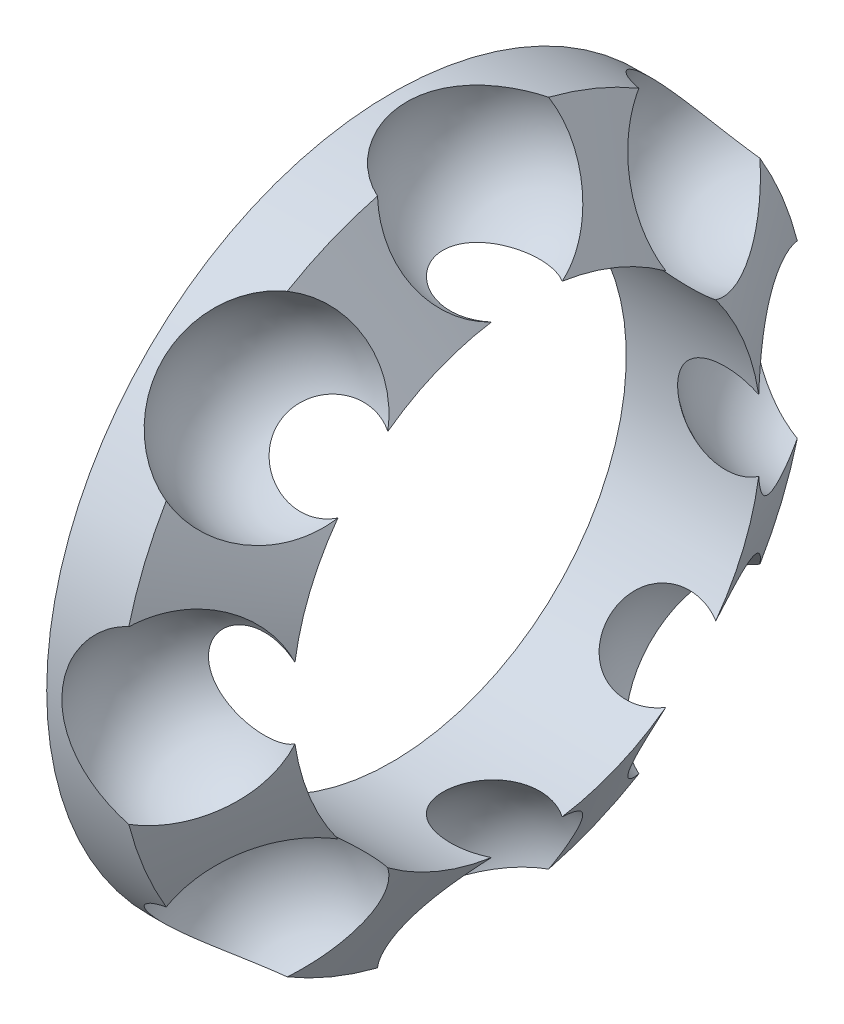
ISO-10303-21;
HEADER;
FILE_DESCRIPTION(('STEP AP214'),'2;1');
FILE_NAME('part.step','',(''),(''),'','','');
FILE_SCHEMA(('AUTOMOTIVE_DESIGN { 1 0 10303 214 1 1 1 1 }'));
ENDSEC;
DATA;
#1=APPLICATION_CONTEXT('core data for automotive mechanical design processes');
#2=APPLICATION_PROTOCOL_DEFINITION('international standard','automotive_design',2000,#1);
#3=PRODUCT_CONTEXT('',#1,'mechanical');
#4=PRODUCT('Part','Part','',(#3));
#5=PRODUCT_RELATED_PRODUCT_CATEGORY('part','',(#4));
#6=PRODUCT_DEFINITION_FORMATION('','',#4);
#7=PRODUCT_DEFINITION_CONTEXT('part definition',#1,'design');
#8=PRODUCT_DEFINITION('design','',#6,#7);
#9=PRODUCT_DEFINITION_SHAPE('','',#8);
#10=(LENGTH_UNIT() NAMED_UNIT(*) SI_UNIT(.MILLI.,.METRE.));
#11=(NAMED_UNIT(*) PLANE_ANGLE_UNIT() SI_UNIT($,.RADIAN.));
#12=(NAMED_UNIT(*) SI_UNIT($,.STERADIAN.) SOLID_ANGLE_UNIT());
#13=UNCERTAINTY_MEASURE_WITH_UNIT(LENGTH_MEASURE(1.E-05),#10,'distance_accuracy_value','');
#14=(GEOMETRIC_REPRESENTATION_CONTEXT(3) GLOBAL_UNCERTAINTY_ASSIGNED_CONTEXT((#13)) GLOBAL_UNIT_ASSIGNED_CONTEXT((#10,
#11,#12)) REPRESENTATION_CONTEXT('',''));
#15=CARTESIAN_POINT('',(0.,0.,0.));
#16=DIRECTION('',(0.,0.,1.));
#17=DIRECTION('',(1.,0.,0.));
#18=AXIS2_PLACEMENT_3D('',#15,#16,#17);
#19=CARTESIAN_POINT('',(3.48039942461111,0.,0.));
#20=DIRECTION('',(-1.,0.,0.));
#21=DIRECTION('',(0.,0.,1.));
#22=AXIS2_PLACEMENT_3D('',#19,#20,#21);
#23=CONICAL_SURFACE('',#22,11.032,1.0471975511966);
#24=CARTESIAN_POINT('',(3.48039942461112,-10.6872304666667,2.73644458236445));
#25=CARTESIAN_POINT('',(3.53550132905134,-10.5762979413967,2.7848830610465));
#26=CARTESIAN_POINT('',(3.59277483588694,-10.4628670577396,2.82496671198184));
#27=CARTESIAN_POINT('',(3.71097691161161,-10.233074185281,2.88803666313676));
#28=CARTESIAN_POINT('',(3.77190820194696,-10.1167100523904,2.91101005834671));
#29=CARTESIAN_POINT('',(3.91319247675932,-9.85234044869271,2.94316149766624));
#30=CARTESIAN_POINT('',(3.99441095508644,-9.70412718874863,2.94706571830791));
#31=CARTESIAN_POINT('',(4.15954244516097,-9.41116354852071,2.92673157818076));
#32=CARTESIAN_POINT('',(4.24345617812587,-9.2664141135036,2.90248562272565));
#33=CARTESIAN_POINT('',(4.4118008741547,-8.98463051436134,2.82658999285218));
#34=CARTESIAN_POINT('',(4.49623174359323,-8.84759499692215,2.77494514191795));
#35=CARTESIAN_POINT('',(4.66313410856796,-8.58505118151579,2.6456910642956));
#36=CARTESIAN_POINT('',(4.74560552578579,-8.45954334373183,2.56808080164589));
#37=CARTESIAN_POINT('',(4.90578514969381,-8.22333443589,2.38897380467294));
#38=CARTESIAN_POINT('',(4.98349169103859,-8.11263852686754,2.28746877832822));
#39=CARTESIAN_POINT('',(5.13097075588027,-7.90881857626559,2.06329780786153));
#40=CARTESIAN_POINT('',(5.20074648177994,-7.81568743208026,1.94064045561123));
#41=CARTESIAN_POINT('',(5.31535696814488,-7.66680519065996,1.70556871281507));
#42=CARTESIAN_POINT('',(5.36233857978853,-7.60731737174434,1.59653670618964));
#43=CARTESIAN_POINT('',(5.44775430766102,-7.50115069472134,1.36934916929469));
#44=CARTESIAN_POINT('',(5.48619225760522,-7.45446608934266,1.25119776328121));
#45=CARTESIAN_POINT('',(5.51960057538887,-7.41447926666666,1.12937912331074));
#46=B_SPLINE_CURVE_WITH_KNOTS('',3,(#24,#25,#26,#27,#28,#29,#30,#31,#32,#33,#34,#35,#36,#37,#38,
#39,#40,#41,#42,#43,#44,#45),.UNSPECIFIED.,.F.,.F.,(4,2,2,2,2,2,2,2,2,2,4),(0.,
0.398591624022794,0.797483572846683,1.3021548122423,1.8069622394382,2.31168082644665,
2.81641955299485,3.32133369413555,3.82604322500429,4.2232581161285,4.62029440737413),.UNSPECIFIED.);
#47=CARTESIAN_POINT('',(3.48039942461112,-10.6872304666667,2.73644458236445));
#48=VERTEX_POINT('',#47);
#49=CARTESIAN_POINT('',(5.51960057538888,-7.41447926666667,1.12937912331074));
#50=VERTEX_POINT('',#49);
#51=EDGE_CURVE('E140',#48,#50,#46,.T.);
#52=ORIENTED_EDGE('',*,*,#51,.T.);
#53=CARTESIAN_POINT('',(5.51960057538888,0.,0.));
#54=DIRECTION('',(-1.,0.,0.));
#55=DIRECTION('',(0.,0.,1.));
#56=AXIS2_PLACEMENT_3D('',#53,#54,#55);
#57=CIRCLE('',#56,7.5);
#58=CARTESIAN_POINT('',(5.51960057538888,-6.0414202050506,4.44423693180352));
#59=VERTEX_POINT('',#58);
#60=EDGE_CURVE('E135',#50,#59,#57,.T.);
#61=ORIENTED_EDGE('',*,*,#60,.T.);
#62=CARTESIAN_POINT('',(5.51960057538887,-6.0414202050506,4.44423693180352));
#63=CARTESIAN_POINT('',(5.49530672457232,-6.12459790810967,4.40218719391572));
#64=CARTESIAN_POINT('',(5.46835476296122,-6.20892777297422,4.36398421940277));
#65=CARTESIAN_POINT('',(5.40972612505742,-6.37918950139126,4.2956484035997));
#66=CARTESIAN_POINT('',(5.37804996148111,-6.46512119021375,4.26551468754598));
#67=CARTESIAN_POINT('',(5.3106513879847,-6.63766581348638,4.21375573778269));
#68=CARTESIAN_POINT('',(5.2749403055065,-6.72427623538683,4.19210741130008));
#69=CARTESIAN_POINT('',(5.20003785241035,-6.89767887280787,4.15745955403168));
#70=CARTESIAN_POINT('',(5.16084692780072,-6.98447106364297,4.14445891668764));
#71=CARTESIAN_POINT('',(5.04900075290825,-7.2227210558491,4.12084125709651));
#72=CARTESIAN_POINT('',(4.97332406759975,-7.37377490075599,4.11935235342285));
#73=CARTESIAN_POINT('',(4.81637275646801,-7.67050459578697,4.14379395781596));
#74=CARTESIAN_POINT('',(4.73510002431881,-7.81618223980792,4.16971523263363));
#75=CARTESIAN_POINT('',(4.56981192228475,-8.09846865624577,4.24832934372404));
#76=CARTESIAN_POINT('',(4.48579693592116,-8.23507868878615,4.30101845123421));
#77=CARTESIAN_POINT('',(4.31756549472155,-8.49552566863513,4.43175831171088));
#78=CARTESIAN_POINT('',(4.23334897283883,-8.61935749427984,4.50981918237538));
#79=CARTESIAN_POINT('',(4.06685061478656,-8.85082127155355,4.68919916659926));
#80=CARTESIAN_POINT('',(3.98457275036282,-8.95842205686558,4.79056210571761));
#81=CARTESIAN_POINT('',(3.82411374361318,-9.15379273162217,5.01345829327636));
#82=CARTESIAN_POINT('',(3.74592773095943,-9.24158662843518,5.13496681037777));
#83=CARTESIAN_POINT('',(3.63775289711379,-9.35149731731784,5.32132122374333));
#84=CARTESIAN_POINT('',(3.60539647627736,-9.3827749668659,5.37958417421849));
#85=CARTESIAN_POINT('',(3.54194635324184,-9.44079132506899,5.49883143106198));
#86=CARTESIAN_POINT('',(3.51085053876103,-9.46753788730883,5.55981079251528));
#87=CARTESIAN_POINT('',(3.48039942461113,-9.49197165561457,5.62205461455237));
#88=B_SPLINE_CURVE_WITH_KNOTS('',3,(#62,#63,#64,#65,#66,#67,#68,#69,#70,#71,#72,#73,#74,#75,#76,
#77,#78,#79,#80,#81,#82,#83,#84,#85,#86,#87),.UNSPECIFIED.,.F.,.F.,(4,2,2,2,2,2,2,2,2,2,2,2,4),
(0.,0.288809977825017,0.577588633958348,0.865575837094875,1.15352618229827,1.65780149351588,
2.16190699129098,2.66594228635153,3.17017882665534,3.67537158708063,4.17994868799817,
4.40064055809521,4.62094590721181),.UNSPECIFIED.);
#89=CARTESIAN_POINT('',(3.48039942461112,-9.49197165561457,5.62205461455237));
#90=VERTEX_POINT('',#89);
#91=EDGE_CURVE('E138',#59,#90,#88,.T.);
#92=ORIENTED_EDGE('',*,*,#91,.T.);
#93=CARTESIAN_POINT('',(3.48039942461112,0.,0.));
#94=DIRECTION('',(-1.,0.,0.));
#95=DIRECTION('',(0.,0.,1.));
#96=AXIS2_PLACEMENT_3D('',#93,#94,#95);
#97=CIRCLE('',#96,11.032);
#98=EDGE_CURVE('E389',#48,#90,#97,.T.);
#99=ORIENTED_EDGE('',*,*,#98,.F.);
#100=EDGE_LOOP('',(#52,#61,#92,#99));
#101=FACE_BOUND('',#100,.T.);
#102=ADVANCED_FACE('F16',(#101),#23,.T.);
#103=CARTESIAN_POINT('',(4.5,-7.07106781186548,7.07106781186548));
#104=DIRECTION('',(0.040868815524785,0.897915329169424,0.43826681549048));
#105=DIRECTION('',(-0.995053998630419,-0.00317022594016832,0.0992848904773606));
#106=AXIS2_PLACEMENT_3D('',#103,#104,#105);
#107=SPHERICAL_SURFACE('',#106,3.);
#108=ORIENTED_EDGE('',*,*,#91,.F.);
#109=CARTESIAN_POINT('',(5.51960057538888,-6.0414202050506,4.44423693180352));
#110=CARTESIAN_POINT('',(5.47680438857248,-6.0585869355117,4.42089677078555));
#111=CARTESIAN_POINT('',(5.43268609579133,-6.07442290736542,4.39909084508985));
#112=CARTESIAN_POINT('',(5.34222516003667,-6.10349594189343,4.35866528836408));
#113=CARTESIAN_POINT('',(5.29588394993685,-6.11673465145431,4.34004363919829));
#114=CARTESIAN_POINT('',(5.15441382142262,-6.15259177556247,4.28921331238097));
#115=CARTESIAN_POINT('',(5.05652197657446,-6.17147469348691,4.26186838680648));
#116=CARTESIAN_POINT('',(4.85689869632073,-6.19960016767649,4.22084973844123));
#117=CARTESIAN_POINT('',(4.75517604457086,-6.20886353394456,4.20714650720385));
#118=CARTESIAN_POINT('',(4.55031196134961,-6.21809779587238,4.19348633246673));
#119=CARTESIAN_POINT('',(4.44716945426,-6.21806120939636,4.19354045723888));
#120=CARTESIAN_POINT('',(4.23858590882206,-6.20850072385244,4.20768319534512));
#121=CARTESIAN_POINT('',(4.13319311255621,-6.19864034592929,4.22226955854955));
#122=CARTESIAN_POINT('',(3.92693774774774,-6.16864809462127,4.26596798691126));
#123=CARTESIAN_POINT('',(3.82607598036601,-6.14851441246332,4.29508260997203));
#124=CARTESIAN_POINT('',(3.63429278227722,-6.09796753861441,4.36653854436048));
#125=CARTESIAN_POINT('',(3.54320703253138,-6.06777919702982,4.40858912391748));
#126=CARTESIAN_POINT('',(3.41529322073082,-6.01445687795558,4.48075787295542));
#127=CARTESIAN_POINT('',(3.37412474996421,-5.99535347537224,4.50631570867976));
#128=CARTESIAN_POINT('',(3.29508952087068,-5.954391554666,4.56030404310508));
#129=CARTESIAN_POINT('',(3.25722634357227,-5.93253010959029,4.58873758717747));
#130=CARTESIAN_POINT('',(3.16755410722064,-5.87450802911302,4.66297575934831));
#131=CARTESIAN_POINT('',(3.11814991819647,-5.83663547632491,4.71039808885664));
#132=CARTESIAN_POINT('',(3.03004888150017,-5.75496469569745,4.80983328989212));
#133=CARTESIAN_POINT('',(2.99133920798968,-5.71117366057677,4.86184056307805));
#134=CARTESIAN_POINT('',(2.94254345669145,-5.64143720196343,4.94221220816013));
#135=CARTESIAN_POINT('',(2.92778947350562,-5.61742985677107,4.96949113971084));
#136=CARTESIAN_POINT('',(2.90162711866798,-5.5682384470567,5.02454831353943));
#137=CARTESIAN_POINT('',(2.89021660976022,-5.54305514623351,5.05232622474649));
#138=CARTESIAN_POINT('',(2.86126799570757,-5.46595625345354,5.13605269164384));
#139=CARTESIAN_POINT('',(2.84897430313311,-5.41243721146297,5.19245709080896));
#140=CARTESIAN_POINT('',(2.83966822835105,-5.30807207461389,5.29900268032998));
#141=CARTESIAN_POINT('',(2.84135402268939,-5.25743305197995,5.34924268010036));
#142=CARTESIAN_POINT('',(2.85683242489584,-5.1557140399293,5.44734787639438));
#143=CARTESIAN_POINT('',(2.87062277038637,-5.1046341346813,5.49521351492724));
#144=CARTESIAN_POINT('',(2.90916636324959,-5.004803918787,5.58626942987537));
#145=CARTESIAN_POINT('',(2.93365879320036,-4.95602705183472,5.62954221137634));
#146=CARTESIAN_POINT('',(2.99247144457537,-4.86092078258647,5.71186577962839));
#147=CARTESIAN_POINT('',(3.02679358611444,-4.81459186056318,5.75091573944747));
#148=CARTESIAN_POINT('',(3.10658044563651,-4.72252272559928,5.82679824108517));
#149=CARTESIAN_POINT('',(3.15263851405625,-4.67703083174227,5.86330592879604));
#150=CARTESIAN_POINT('',(3.25285802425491,-4.59117459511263,5.93077598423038));
#151=CARTESIAN_POINT('',(3.30702296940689,-4.55081248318,5.96173594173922));
#152=CARTESIAN_POINT('',(3.42898649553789,-4.47135877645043,6.02160501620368));
#153=CARTESIAN_POINT('',(3.49764267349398,-4.43303884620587,6.04978938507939));
#154=CARTESIAN_POINT('',(3.64117479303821,-4.36455979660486,6.09937758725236));
#155=CARTESIAN_POINT('',(3.71605370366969,-4.33440460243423,6.12077816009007));
#156=CARTESIAN_POINT('',(3.88065696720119,-4.27922048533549,6.15951024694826));
#157=CARTESIAN_POINT('',(3.97102038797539,-4.25543417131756,6.17590168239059));
#158=CARTESIAN_POINT('',(4.15510216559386,-4.21934588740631,6.20061248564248));
#159=CARTESIAN_POINT('',(4.24882275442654,-4.20705171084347,6.20892637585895));
#160=CARTESIAN_POINT('',(4.44686891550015,-4.19349307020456,6.21809458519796));
#161=CARTESIAN_POINT('',(4.55131947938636,-4.1934516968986,6.21812171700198));
#162=CARTESIAN_POINT('',(4.75876508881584,-4.20748992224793,6.208630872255));
#163=CARTESIAN_POINT('',(4.86176081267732,-4.22156270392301,6.19911750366));
#164=CARTESIAN_POINT('',(5.06150890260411,-4.26319044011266,6.1705617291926));
#165=CARTESIAN_POINT('',(5.15834529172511,-4.29046775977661,6.1517153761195));
#166=CARTESIAN_POINT('',(5.29829009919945,-4.34099145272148,6.11606163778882));
#167=CARTESIAN_POINT('',(5.34411998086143,-4.35946993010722,6.10292035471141));
#168=CARTESIAN_POINT('',(5.43359954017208,-4.39954249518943,6.07409493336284));
#169=CARTESIAN_POINT('',(5.47724782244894,-4.4211385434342,6.05840919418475));
#170=CARTESIAN_POINT('',(5.51960057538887,-4.44423693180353,6.04142020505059));
#171=B_SPLINE_CURVE_WITH_KNOTS('',3,(#109,#110,#111,#112,#113,#114,#115,#116,#117,#118,#119,
#120,#121,#122,#123,#124,#125,#126,#127,#128,#129,#130,#131,#132,#133,#134,#135,#136,#137,#138,
#139,#140,#141,#142,#143,#144,#145,#146,#147,#148,#149,#150,#151,#152,#153,#154,#155,#156,#157,
#158,#159,#160,#161,#162,#163,#164,#165,#166,#167,#168,#169,#170),.UNSPECIFIED.,.F.,.F.,(4,2,2,
2,2,2,2,2,2,2,2,2,2,2,2,2,2,2,2,2,2,2,2,2,2,2,2,2,2,2,4),(0.,0.154916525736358,
0.309734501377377,0.618245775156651,0.926088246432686,1.23417838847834,1.55319680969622,
1.87227141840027,2.18464255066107,2.34068410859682,2.49689267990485,2.73062751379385,
2.96408080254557,3.08159360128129,3.19903111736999,3.43363487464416,3.64665514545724,
3.85963561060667,4.06769226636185,4.27578959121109,4.49785712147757,4.72002089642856,
4.96960494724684,5.21930877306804,5.50274112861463,5.78636555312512,6.09829306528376,
6.41006999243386,6.71555895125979,6.86877686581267,7.02209155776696),.UNSPECIFIED.);
#172=CARTESIAN_POINT('',(5.51960057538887,-4.44423693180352,6.0414202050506));
#173=VERTEX_POINT('',#172);
#174=EDGE_CURVE('E144',#59,#173,#171,.T.);
#175=ORIENTED_EDGE('',*,*,#174,.T.);
#176=CARTESIAN_POINT('',(3.48039942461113,-5.62205461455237,9.49197165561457));
#177=CARTESIAN_POINT('',(3.5152657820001,-5.55077348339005,9.4640013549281));
#178=CARTESIAN_POINT('',(3.55100073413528,-5.48112505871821,9.43296808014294));
#179=CARTESIAN_POINT('',(3.62402318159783,-5.34559116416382,9.36507309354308));
#180=CARTESIAN_POINT('',(3.66131057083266,-5.27970543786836,9.32821177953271));
#181=CARTESIAN_POINT('',(3.73722715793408,-5.15223649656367,9.24898657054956));
#182=CARTESIAN_POINT('',(3.77585523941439,-5.09064982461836,9.20662717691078));
#183=CARTESIAN_POINT('',(3.8542624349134,-4.97218791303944,9.11674644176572));
#184=CARTESIAN_POINT('',(3.89404154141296,-4.91531264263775,9.0692251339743));
#185=CARTESIAN_POINT('',(4.01482358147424,-4.75235305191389,8.91940794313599));
#186=CARTESIAN_POINT('',(4.09730850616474,-4.65387219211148,8.80981964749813));
#187=CARTESIAN_POINT('',(4.26404472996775,-4.48038858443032,8.57474096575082));
#188=CARTESIAN_POINT('',(4.348295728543,-4.40538187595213,8.4492532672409));
#189=CARTESIAN_POINT('',(4.51648577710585,-4.28077858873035,8.18568219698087));
#190=CARTESIAN_POINT('',(4.60042408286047,-4.2312241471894,8.04757838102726));
#191=CARTESIAN_POINT('',(4.76523040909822,-4.15907927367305,7.76270684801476));
#192=CARTESIAN_POINT('',(4.84609752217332,-4.13649675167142,7.61593660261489));
#193=CARTESIAN_POINT('',(5.00177948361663,-4.11880796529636,7.31760691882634));
#194=CARTESIAN_POINT('',(5.0765938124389,-4.12370405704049,7.16604707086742));
#195=CARTESIAN_POINT('',(5.21690005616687,-4.16062839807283,6.86200200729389));
#196=CARTESIAN_POINT('',(5.28240065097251,-4.19263118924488,6.70951779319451));
#197=CARTESIAN_POINT('',(5.37591326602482,-4.26356263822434,6.47084821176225));
#198=CARTESIAN_POINT('',(5.40812777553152,-4.29395953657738,6.38367465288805));
#199=CARTESIAN_POINT('',(5.46766042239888,-4.36300723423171,6.21109504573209));
#200=CARTESIAN_POINT('',(5.49498526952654,-4.40164656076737,6.12568671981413));
#201=CARTESIAN_POINT('',(5.51960057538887,-4.44423693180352,6.0414202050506));
#202=B_SPLINE_CURVE_WITH_KNOTS('',3,(#176,#177,#178,#179,#180,#181,#182,#183,#184,#185,#186,
#187,#188,#189,#190,#191,#192,#193,#194,#195,#196,#197,#198,#199,#200,#201),.UNSPECIFIED.,.F.,
.F.,(4,2,2,2,2,2,2,2,2,2,2,2,4),(0.,0.252326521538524,0.504635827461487,0.756739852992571,
1.00884223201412,1.51280163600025,2.01667596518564,2.52138181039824,3.02623563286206,
3.53113274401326,4.03555619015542,4.32845616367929,4.6209510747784),.UNSPECIFIED.);
#203=CARTESIAN_POINT('',(3.48039942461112,-5.62205461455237,9.49197165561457));
#204=VERTEX_POINT('',#203);
#205=EDGE_CURVE('E153',#204,#173,#202,.T.);
#206=ORIENTED_EDGE('',*,*,#205,.F.);
#207=CARTESIAN_POINT('',(3.48039942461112,-9.49197165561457,5.62205461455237));
#208=CARTESIAN_POINT('',(3.387152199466,-9.47243994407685,5.65501602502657));
#209=CARTESIAN_POINT('',(3.29610050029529,-9.45011588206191,5.69233012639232));
#210=CARTESIAN_POINT('',(3.11919336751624,-9.39989736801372,5.77488821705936));
#211=CARTESIAN_POINT('',(3.0333416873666,-9.37199895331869,5.82013784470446));
#212=CARTESIAN_POINT('',(2.81918455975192,-9.29267622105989,5.94638730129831));
#213=CARTESIAN_POINT('',(2.69553850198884,-9.23705479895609,6.03278149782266));
#214=CARTESIAN_POINT('',(2.46686623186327,-9.11237558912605,6.21950401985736));
#215=CARTESIAN_POINT('',(2.3618581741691,-9.04330483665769,6.31984576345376));
#216=CARTESIAN_POINT('',(2.1722664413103,-8.89204164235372,6.53096911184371));
#217=CARTESIAN_POINT('',(2.08781231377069,-8.80977113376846,6.64181111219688));
#218=CARTESIAN_POINT('',(1.94193151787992,-8.63361805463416,6.86923139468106));
#219=CARTESIAN_POINT('',(1.88050402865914,-8.53973589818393,6.98580947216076));
#220=CARTESIAN_POINT('',(1.78034047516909,-8.33896905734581,7.22437827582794));
#221=CARTESIAN_POINT('',(1.74236063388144,-8.23177321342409,7.34642518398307));
#222=CARTESIAN_POINT('',(1.69289766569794,-8.00922989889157,7.58843048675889));
#223=CARTESIAN_POINT('',(1.68141423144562,-7.89388252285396,7.70838890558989));
#224=CARTESIAN_POINT('',(1.68511484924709,-7.66111674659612,7.939681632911));
#225=CARTESIAN_POINT('',(1.69961774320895,-7.54382879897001,8.05115866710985));
#226=CARTESIAN_POINT('',(1.75370037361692,-7.30769209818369,8.26608445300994));
#227=CARTESIAN_POINT('',(1.79327915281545,-7.18884340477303,8.36953351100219));
#228=CARTESIAN_POINT('',(1.89768922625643,-6.95118626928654,8.56798887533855));
#229=CARTESIAN_POINT('',(1.96295947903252,-6.8324165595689,8.6628111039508));
#230=CARTESIAN_POINT('',(2.11739954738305,-6.60133052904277,8.84017536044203));
#231=CARTESIAN_POINT('',(2.20657625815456,-6.48901608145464,8.92271383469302));
#232=CARTESIAN_POINT('',(2.40702240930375,-6.27517251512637,9.07438553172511));
#233=CARTESIAN_POINT('',(2.51832708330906,-6.17366099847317,9.14349702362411));
#234=CARTESIAN_POINT('',(2.76024503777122,-5.98620080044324,9.26731113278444));
#235=CARTESIAN_POINT('',(2.89083245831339,-5.90023161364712,9.32203277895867));
#236=CARTESIAN_POINT('',(3.10064631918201,-5.7848807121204,9.39373876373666));
#237=CARTESIAN_POINT('',(3.17415659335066,-5.74824378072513,9.41617233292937));
#238=CARTESIAN_POINT('',(3.32472711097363,-5.68073400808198,9.45705110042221));
#239=CARTESIAN_POINT('',(3.4017829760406,-5.64985428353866,9.47550106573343));
#240=CARTESIAN_POINT('',(3.48039942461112,-5.62205461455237,9.49197165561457));
#241=B_SPLINE_CURVE_WITH_KNOTS('',3,(#207,#208,#209,#210,#211,#212,#213,#214,#215,#216,#217,
#218,#219,#220,#221,#222,#223,#224,#225,#226,#227,#228,#229,#230,#231,#232,#233,#234,#235,#236,
#237,#238,#239,#240),.UNSPECIFIED.,.F.,.F.,(4,2,2,2,2,2,2,2,2,2,2,2,2,2,2,2,4),(0.,
0.302160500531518,0.604536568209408,1.08439662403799,1.56472156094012,2.04799974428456,
2.53126069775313,3.02938882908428,3.52751118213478,4.01276706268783,4.49800442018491,
4.99191978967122,5.48597776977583,5.9808288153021,6.47502214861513,6.73013134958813,
6.98493355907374),.UNSPECIFIED.);
#242=EDGE_CURVE('E151',#90,#204,#241,.T.);
#243=ORIENTED_EDGE('',*,*,#242,.F.);
#244=EDGE_LOOP('',(#108,#175,#206,#243));
#245=FACE_BOUND('',#244,.T.);
#246=ADVANCED_FACE('F148',(#245),#107,.F.);
#247=CARTESIAN_POINT('',(3.48039942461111,0.,0.));
#248=DIRECTION('',(-1.,0.,0.));
#249=DIRECTION('',(0.,0.,1.));
#250=AXIS2_PLACEMENT_3D('',#247,#248,#249);
#251=CONICAL_SURFACE('',#250,11.032,1.0471975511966);
#252=ORIENTED_EDGE('',*,*,#205,.T.);
#253=CARTESIAN_POINT('',(5.51960057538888,0.,0.));
#254=DIRECTION('',(-1.,0.,0.));
#255=DIRECTION('',(0.,0.,1.));
#256=AXIS2_PLACEMENT_3D('',#253,#254,#255);
#257=CIRCLE('',#256,7.5);
#258=CARTESIAN_POINT('',(5.51960057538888,-1.12937912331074,7.41447926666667));
#259=VERTEX_POINT('',#258);
#260=EDGE_CURVE('E157',#173,#259,#257,.T.);
#261=ORIENTED_EDGE('',*,*,#260,.T.);
#262=CARTESIAN_POINT('',(5.51960057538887,-1.12937912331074,7.41447926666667));
#263=CARTESIAN_POINT('',(5.49860916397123,-1.20588008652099,7.43960833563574));
#264=CARTESIAN_POINT('',(5.47563622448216,-1.28096272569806,7.46737205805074));
#265=CARTESIAN_POINT('',(5.42610524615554,-1.4277894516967,7.52802595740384));
#266=CARTESIAN_POINT('',(5.39954767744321,-1.49953397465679,7.56091546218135));
#267=CARTESIAN_POINT('',(5.34321058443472,-1.63922547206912,7.63169618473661));
#268=CARTESIAN_POINT('',(5.31343002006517,-1.70717120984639,7.66958901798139));
#269=CARTESIAN_POINT('',(5.25106381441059,-1.83877214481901,7.75016592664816));
#270=CARTESIAN_POINT('',(5.21847819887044,-1.90242738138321,7.7928499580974));
#271=CARTESIAN_POINT('',(5.11709970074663,-2.0863370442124,7.92779773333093));
#272=CARTESIAN_POINT('',(5.04464549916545,-2.19963229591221,8.02700616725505));
#273=CARTESIAN_POINT('',(4.89337029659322,-2.404221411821,8.24141809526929));
#274=CARTESIAN_POINT('',(4.81456154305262,-2.49555630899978,8.35659111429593));
#275=CARTESIAN_POINT('',(4.69387988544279,-2.61432027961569,8.53896883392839));
#276=CARTESIAN_POINT('',(4.6533020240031,-2.65082864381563,8.60126691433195));
#277=CARTESIAN_POINT('',(4.57158431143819,-2.71765094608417,8.72874188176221));
#278=CARTESIAN_POINT('',(4.53044449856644,-2.74796530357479,8.79391857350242));
#279=CARTESIAN_POINT('',(4.40557025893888,-2.8299966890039,8.99488140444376));
#280=CARTESIAN_POINT('',(4.32139135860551,-2.87180976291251,9.13457730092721));
#281=CARTESIAN_POINT('',(4.15417364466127,-2.92794018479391,9.42047680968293));
#282=CARTESIAN_POINT('',(4.0711378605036,-2.94219476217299,9.56669450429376));
#283=CARTESIAN_POINT('',(3.94451259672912,-2.94253643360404,9.79574904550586));
#284=CARTESIAN_POINT('',(3.89972001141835,-2.93829328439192,9.878015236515));
#285=CARTESIAN_POINT('',(3.81146980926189,-2.92111234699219,10.0423985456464));
#286=CARTESIAN_POINT('',(3.76801240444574,-2.90817318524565,10.1245156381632));
#287=CARTESIAN_POINT('',(3.68272928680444,-2.87367632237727,10.2878130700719));
#288=CARTESIAN_POINT('',(3.64090415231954,-2.8521155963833,10.3689930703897));
#289=CARTESIAN_POINT('',(3.559159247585,-2.80055980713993,10.5296108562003));
#290=CARTESIAN_POINT('',(3.51923940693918,-2.77056505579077,10.6090487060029));
#291=CARTESIAN_POINT('',(3.48039942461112,-2.73644458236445,10.6872304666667));
#292=B_SPLINE_CURVE_WITH_KNOTS('',3,(#262,#263,#264,#265,#266,#267,#268,#269,#270,#271,#272,
#273,#274,#275,#276,#277,#278,#279,#280,#281,#282,#283,#284,#285,#286,#287,#288,#289,#290,#291),
.UNSPECIFIED.,.F.,.F.,(4,2,2,2,2,2,2,2,2,2,2,2,2,2,4),(0.,0.249550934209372,0.499069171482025,
0.748668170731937,0.998264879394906,1.49711593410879,1.99502751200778,2.24326254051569,
2.49148075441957,2.9940779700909,3.49781861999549,3.77875828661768,4.05974233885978,
4.34082506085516,4.62189738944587),.UNSPECIFIED.);
#293=CARTESIAN_POINT('',(3.48039942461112,-2.73644458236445,10.6872304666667));
#294=VERTEX_POINT('',#293);
#295=EDGE_CURVE('E365',#259,#294,#292,.T.);
#296=ORIENTED_EDGE('',*,*,#295,.T.);
#297=CARTESIAN_POINT('',(3.48039942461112,0.,0.));
#298=DIRECTION('',(-1.,0.,0.));
#299=DIRECTION('',(0.,0.,1.));
#300=AXIS2_PLACEMENT_3D('',#297,#298,#299);
#301=CIRCLE('',#300,11.032);
#302=EDGE_CURVE('E382',#204,#294,#301,.T.);
#303=ORIENTED_EDGE('',*,*,#302,.F.);
#304=EDGE_LOOP('',(#252,#261,#296,#303));
#305=FACE_BOUND('',#304,.T.);
#306=ADVANCED_FACE('F351',(#305),#251,.T.);
#307=CARTESIAN_POINT('',(4.5,0.,10.));
#308=DIRECTION('',(0.040868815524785,0.897915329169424,0.43826681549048));
#309=DIRECTION('',(-0.995053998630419,-0.00317022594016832,0.0992848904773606));
#310=AXIS2_PLACEMENT_3D('',#307,#308,#309);
#311=SPHERICAL_SURFACE('',#310,3.);
#312=CARTESIAN_POINT('',(4.37739355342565,-2.69374598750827,8.68519955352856));
#313=VERTEX_POINT('',#312);
#314=VERTEX_LOOP('',#313);
#315=FACE_BOUND('',#314,.T.);
#316=CARTESIAN_POINT('',(3.48039942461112,2.73644458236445,10.6872304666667));
#317=CARTESIAN_POINT('',(3.51526578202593,2.76706996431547,10.6170491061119));
#318=CARTESIAN_POINT('',(3.55100073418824,2.79437499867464,10.545856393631));
#319=CARTESIAN_POINT('',(3.6240231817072,2.84220292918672,10.4020104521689));
#320=CARTESIAN_POINT('',(3.66131057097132,2.86272628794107,10.3293573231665));
#321=CARTESIAN_POINT('',(3.73722715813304,2.89683975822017,10.1832024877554));
#322=CARTESIAN_POINT('',(3.77585523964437,2.91043549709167,10.1097015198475));
#323=CARTESIAN_POINT('',(3.85426243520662,2.93064544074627,9.96238102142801));
#324=CARTESIAN_POINT('',(3.89404154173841,2.93725969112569,9.88856149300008));
#325=CARTESIAN_POINT('',(4.01482358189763,2.94655277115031,9.66739490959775));
#326=CARTESIAN_POINT('',(4.09730850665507,2.9386986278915,9.52026779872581));
#327=CARTESIAN_POINT('',(4.26404473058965,2.89514433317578,9.23137063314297));
#328=CARTESIAN_POINT('',(4.34829572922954,2.85944888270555,9.08959967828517));
#329=CARTESIAN_POINT('',(4.51648577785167,2.76118382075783,8.81511895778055));
#330=CARTESIAN_POINT('',(4.60042408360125,2.69856995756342,8.68242453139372));
#331=CARTESIAN_POINT('',(4.76523040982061,2.5481494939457,8.42997580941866));
#332=CARTESIAN_POINT('',(4.84609752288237,2.46033551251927,8.31022531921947));
#333=CARTESIAN_POINT('',(5.0017794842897,2.26189243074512,8.08676651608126));
#334=CARTESIAN_POINT('',(5.07659381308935,2.15126137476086,7.98305957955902));
#335=CARTESIAN_POINT('',(5.21690005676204,1.91015959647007,7.79417670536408));
#336=CARTESIAN_POINT('',(5.28240065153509,1.77970758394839,7.70898347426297));
#337=CARTESIAN_POINT('',(5.37591326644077,1.56078659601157,7.59037470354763));
#338=CARTESIAN_POINT('',(5.40812777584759,1.47765172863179,7.55022754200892));
#339=CARTESIAN_POINT('',(5.46766042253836,1.30679542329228,7.47701942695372));
#340=CARTESIAN_POINT('',(5.4949852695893,1.21908048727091,7.44394875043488));
#341=CARTESIAN_POINT('',(5.51960057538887,1.12937912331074,7.41447926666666));
#342=B_SPLINE_CURVE_WITH_KNOTS('',3,(#316,#317,#318,#319,#320,#321,#322,#323,#324,#325,#326,
#327,#328,#329,#330,#331,#332,#333,#334,#335,#336,#337,#338,#339,#340,#341),.UNSPECIFIED.,.F.,
.F.,(4,2,2,2,2,2,2,2,2,2,2,2,4),(0.,0.252326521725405,0.5046358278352,0.756739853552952,
1.00884223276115,1.51280163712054,2.01667596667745,2.52138181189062,3.02623563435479,
3.53113274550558,4.03555619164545,4.32845616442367,4.62095107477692),.UNSPECIFIED.);
#343=CARTESIAN_POINT('',(3.48039942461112,2.73644458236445,10.6872304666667));
#344=VERTEX_POINT('',#343);
#345=CARTESIAN_POINT('',(5.51960057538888,1.12937912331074,7.41447926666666));
#346=VERTEX_POINT('',#345);
#347=EDGE_CURVE('E359',#344,#346,#342,.T.);
#348=ORIENTED_EDGE('',*,*,#347,.F.);
#349=CARTESIAN_POINT('',(3.48039942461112,-2.73644458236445,10.6872304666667));
#350=CARTESIAN_POINT('',(3.40659623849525,-2.70706525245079,10.6947498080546));
#351=CARTESIAN_POINT('',(3.33414098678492,-2.67450872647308,10.7029599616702));
#352=CARTESIAN_POINT('',(3.19242265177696,-2.60336052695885,10.7204896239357));
#353=CARTESIAN_POINT('',(3.12315862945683,-2.56477064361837,10.7298088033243));
#354=CARTESIAN_POINT('',(2.98844295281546,-2.48196058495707,10.7492647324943));
#355=CARTESIAN_POINT('',(2.92298222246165,-2.4377546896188,10.7593993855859));
#356=CARTESIAN_POINT('',(2.79611350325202,-2.34400920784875,10.7802113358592));
#357=CARTESIAN_POINT('',(2.73470571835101,-2.2944693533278,10.7908886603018));
#358=CARTESIAN_POINT('',(2.5572218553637,-2.13846755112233,10.8232719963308));
#359=CARTESIAN_POINT('',(2.44767151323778,-2.02449124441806,10.8453617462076));
#360=CARTESIAN_POINT('',(2.24869637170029,-1.77992879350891,10.8881718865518));
#361=CARTESIAN_POINT('',(2.15928514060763,-1.64933154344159,10.9088913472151));
#362=CARTESIAN_POINT('',(2.0002238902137,-1.37125799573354,10.9473697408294));
#363=CARTESIAN_POINT('',(1.93119544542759,-1.22341218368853,10.9650298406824));
#364=CARTESIAN_POINT('',(1.81782703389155,-0.918160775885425,10.9947916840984));
#365=CARTESIAN_POINT('',(1.77345973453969,-0.76076597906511,11.0068995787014));
#366=CARTESIAN_POINT('',(1.72228314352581,-0.501997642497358,11.0210193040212));
#367=CARTESIAN_POINT('',(1.70759916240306,-0.402223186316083,11.0251214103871));
#368=CARTESIAN_POINT('',(1.68800129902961,-0.201648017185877,11.0306133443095));
#369=CARTESIAN_POINT('',(1.68308734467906,-0.100847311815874,11.0320031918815));
#370=CARTESIAN_POINT('',(1.68309721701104,0.167428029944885,11.0319947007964));
#371=CARTESIAN_POINT('',(1.69665797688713,0.334984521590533,11.0281497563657));
#372=CARTESIAN_POINT('',(1.75067928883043,0.665522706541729,11.0131542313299));
#373=CARTESIAN_POINT('',(1.79117420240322,0.828498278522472,11.0019943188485));
#374=CARTESIAN_POINT('',(1.89824585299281,1.14505378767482,10.973564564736));
#375=CARTESIAN_POINT('',(1.96481531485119,1.29863633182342,10.956296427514));
#376=CARTESIAN_POINT('',(2.12263789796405,1.59197676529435,10.9175338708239));
#377=CARTESIAN_POINT('',(2.21388987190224,1.73173529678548,10.8960396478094));
#378=CARTESIAN_POINT('',(2.4182221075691,1.99223124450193,10.8514238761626));
#379=CARTESIAN_POINT('',(2.53113297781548,2.11310385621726,10.8283157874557));
#380=CARTESIAN_POINT('',(2.77643616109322,2.333186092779,10.7830377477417));
#381=CARTESIAN_POINT('',(2.90880104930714,2.43242573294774,10.7608665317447));
#382=CARTESIAN_POINT('',(3.11748928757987,2.56154876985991,10.7305822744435));
#383=CARTESIAN_POINT('',(3.18787152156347,2.60095354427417,10.7210765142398));
#384=CARTESIAN_POINT('',(3.33183167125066,2.67346581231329,10.7032226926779));
#385=CARTESIAN_POINT('',(3.40540532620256,2.70658140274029,10.6948731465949));
#386=CARTESIAN_POINT('',(3.48039942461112,2.73644458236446,10.6872304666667));
#387=B_SPLINE_CURVE_WITH_KNOTS('',3,(#349,#350,#351,#352,#353,#354,#355,#356,#357,#358,#359,
#360,#361,#362,#363,#364,#365,#366,#367,#368,#369,#370,#371,#372,#373,#374,#375,#376,#377,#378,
#379,#380,#381,#382,#383,#384,#385,#386),.UNSPECIFIED.,.F.,.F.,(4,2,2,2,2,2,2,2,2,2,2,2,2,2,2,2,
2,2,4),(0.,0.239277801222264,0.478484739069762,0.717095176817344,0.955717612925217,
1.43221187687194,1.90902621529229,2.39915596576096,2.88874140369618,3.19106518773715,
3.49338674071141,3.99530494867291,4.49786471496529,5.00028435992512,5.50268065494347,
6.00129714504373,6.49921734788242,6.74260553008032,6.98567821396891),.UNSPECIFIED.);
#388=EDGE_CURVE('E329',#294,#344,#387,.T.);
#389=ORIENTED_EDGE('',*,*,#388,.F.);
#390=ORIENTED_EDGE('',*,*,#295,.F.);
#391=CARTESIAN_POINT('',(5.51960057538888,-1.12937912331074,7.41447926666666));
#392=CARTESIAN_POINT('',(5.47680417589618,-1.15802194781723,7.41011397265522));
#393=CARTESIAN_POINT('',(5.43268567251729,-1.18463890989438,7.40589255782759));
#394=CARTESIAN_POINT('',(5.34222430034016,-1.23378203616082,7.39786507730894));
#395=CARTESIAN_POINT('',(5.29588286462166,-1.25631079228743,7.39405874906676));
#396=CARTESIAN_POINT('',(5.15441287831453,-1.31760783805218,7.38347113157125));
#397=CARTESIAN_POINT('',(5.05652140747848,-1.35029559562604,7.37748763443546));
#398=CARTESIAN_POINT('',(4.85689893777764,-1.39918790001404,7.36837078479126));
#399=CARTESIAN_POINT('',(4.75517670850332,-1.41542797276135,7.36523129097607));
#400=CARTESIAN_POINT('',(4.55031188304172,-1.43161615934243,7.36210179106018));
#401=CARTESIAN_POINT('',(4.44716820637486,-1.43155110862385,7.36211432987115));
#402=CARTESIAN_POINT('',(4.23858798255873,-1.41479299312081,7.36535407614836));
#403=CARTESIAN_POINT('',(4.1331998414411,-1.39751032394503,7.36869527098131));
#404=CARTESIAN_POINT('',(3.92693347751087,-1.34539348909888,7.37838846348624));
#405=CARTESIAN_POINT('',(3.82605610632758,-1.31055602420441,7.3847410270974));
#406=CARTESIAN_POINT('',(3.63430712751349,-1.22432067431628,7.39952091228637));
#407=CARTESIAN_POINT('',(3.54327013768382,-1.17328513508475,7.40790196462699));
#408=CARTESIAN_POINT('',(3.37265795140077,-1.05489551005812,7.42568192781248));
#409=CARTESIAN_POINT('',(3.29306303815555,-0.987570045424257,7.43507903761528));
#410=CARTESIAN_POINT('',(3.16755195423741,-0.856687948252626,7.45112517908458));
#411=CARTESIAN_POINT('',(3.11819653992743,-0.796424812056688,7.45787208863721));
#412=CARTESIAN_POINT('',(3.03010912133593,-0.668409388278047,7.47043192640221));
#413=CARTESIAN_POINT('',(2.99137715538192,-0.600657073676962,7.4762448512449));
#414=CARTESIAN_POINT('',(2.92618788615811,-0.458844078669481,7.48629027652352));
#415=CARTESIAN_POINT('',(2.89980685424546,-0.384747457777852,7.49051292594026));
#416=CARTESIAN_POINT('',(2.86121693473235,-0.233000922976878,7.49676124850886));
#417=CARTESIAN_POINT('',(2.8489643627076,-0.155362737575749,7.49879369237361));
#418=CARTESIAN_POINT('',(2.84248839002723,-0.0516171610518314,7.49986745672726));
#419=CARTESIAN_POINT('',(2.84168637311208,-0.0258116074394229,7.50000034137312));
#420=CARTESIAN_POINT('',(2.84168932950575,0.0361423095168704,7.4999995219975));
#421=CARTESIAN_POINT('',(2.84326594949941,0.0722964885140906,7.49973783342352));
#422=CARTESIAN_POINT('',(2.84955609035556,0.144332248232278,7.4986978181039));
#423=CARTESIAN_POINT('',(2.85427100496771,0.180213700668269,7.49791926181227));
#424=CARTESIAN_POINT('',(2.86678928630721,0.251500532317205,7.49586687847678));
#425=CARTESIAN_POINT('',(2.87459917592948,0.286904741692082,7.49459200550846));
#426=CARTESIAN_POINT('',(2.89320599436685,0.356909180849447,7.49158507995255));
#427=CARTESIAN_POINT('',(2.90400451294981,0.391508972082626,7.48985278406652));
#428=CARTESIAN_POINT('',(2.94057322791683,0.493386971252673,7.48406061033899));
#429=CARTESIAN_POINT('',(2.97059003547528,0.559151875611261,7.47939282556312));
#430=CARTESIAN_POINT('',(3.04066962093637,0.68499520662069,7.46892139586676));
#431=CARTESIAN_POINT('',(3.08073961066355,0.745069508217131,7.46311693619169));
#432=CARTESIAN_POINT('',(3.14832342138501,0.831505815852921,7.45382434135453));
#433=CARTESIAN_POINT('',(3.17277533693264,0.860340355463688,7.4505437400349));
#434=CARTESIAN_POINT('',(3.22378619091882,0.916015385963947,7.44390355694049));
#435=CARTESIAN_POINT('',(3.25034290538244,0.942857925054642,7.44054406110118));
#436=CARTESIAN_POINT('',(3.33293014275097,1.02034740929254,7.43045141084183));
#437=CARTESIAN_POINT('',(3.39186500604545,1.06794010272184,7.42370589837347));
#438=CARTESIAN_POINT('',(3.52398178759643,1.16020308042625,7.40988482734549));
#439=CARTESIAN_POINT('',(3.59801708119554,1.20365420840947,7.40288362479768));
#440=CARTESIAN_POINT('',(3.75175845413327,1.27923804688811,7.39019739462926));
#441=CARTESIAN_POINT('',(3.83146724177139,1.31136530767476,7.38451300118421));
#442=CARTESIAN_POINT('',(4.00535685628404,1.36766372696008,7.37430871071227));
#443=CARTESIAN_POINT('',(4.10006777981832,1.39024678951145,7.37003802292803));
#444=CARTESIAN_POINT('',(4.29193591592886,1.42082556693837,7.36420346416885));
#445=CARTESIAN_POINT('',(4.38909493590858,1.42881016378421,7.36264165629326));
#446=CARTESIAN_POINT('',(4.59183843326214,1.4302382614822,7.36236577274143));
#447=CARTESIAN_POINT('',(4.69743453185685,1.42238305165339,7.3639060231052));
#448=CARTESIAN_POINT('',(4.90573758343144,1.38945483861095,7.37018939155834));
#449=CARTESIAN_POINT('',(5.00844756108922,1.36440061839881,7.37492901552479));
#450=CARTESIAN_POINT('',(5.1807817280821,1.3062729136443,7.38540934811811));
#451=CARTESIAN_POINT('',(5.25181677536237,1.27722436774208,7.39052874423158));
#452=CARTESIAN_POINT('',(5.38940779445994,1.21007616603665,7.40181170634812));
#453=CARTESIAN_POINT('',(5.45596188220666,1.17197273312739,7.40797570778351));
#454=CARTESIAN_POINT('',(5.51960057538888,1.12937912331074,7.41447926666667));
#455=B_SPLINE_CURVE_WITH_KNOTS('',3,(#391,#392,#393,#394,#395,#396,#397,#398,#399,#400,#401,
#402,#403,#404,#405,#406,#407,#408,#409,#410,#411,#412,#413,#414,#415,#416,#417,#418,#419,#420,
#421,#422,#423,#424,#425,#426,#427,#428,#429,#430,#431,#432,#433,#434,#435,#436,#437,#438,#439,
#440,#441,#442,#443,#444,#445,#446,#447,#448,#449,#450,#451,#452,#453,#454),.UNSPECIFIED.,.F.,
.F.,(4,2,2,2,2,2,2,2,2,2,2,2,2,2,2,2,2,2,2,2,2,2,2,2,2,2,2,2,2,2,2,4),(0.,0.154917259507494,
0.309735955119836,0.618245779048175,0.926087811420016,1.23417839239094,1.55319491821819,
1.87227142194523,2.18466124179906,2.49650613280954,2.73009975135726,2.96369421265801,
3.19871277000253,3.43300269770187,3.5104269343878,3.61883904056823,3.72729932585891,
3.83598942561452,3.94473745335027,4.16100526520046,4.37742866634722,4.49117582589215,
4.60480436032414,4.83212269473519,5.08950781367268,5.34701663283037,5.63817271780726,
5.92955045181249,6.24578744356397,6.56167962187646,6.79179384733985,7.02200423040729),.UNSPECIFIED.);
#456=EDGE_CURVE('E159',#259,#346,#455,.T.);
#457=ORIENTED_EDGE('',*,*,#456,.T.);
#458=EDGE_LOOP('',(#348,#389,#390,#457));
#459=FACE_BOUND('',#458,.T.);
#460=ADVANCED_FACE('F348',(#315,#459),#311,.F.);
#461=CARTESIAN_POINT('',(3.48039942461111,0.,0.));
#462=DIRECTION('',(-1.,0.,0.));
#463=DIRECTION('',(0.,0.,1.));
#464=AXIS2_PLACEMENT_3D('',#461,#462,#463);
#465=CONICAL_SURFACE('',#464,11.032,1.0471975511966);
#466=ORIENTED_EDGE('',*,*,#347,.T.);
#467=CARTESIAN_POINT('',(5.51960057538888,0.,0.));
#468=DIRECTION('',(-1.,0.,0.));
#469=DIRECTION('',(0.,0.,1.));
#470=AXIS2_PLACEMENT_3D('',#467,#468,#469);
#471=CIRCLE('',#470,7.5);
#472=CARTESIAN_POINT('',(5.51960057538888,4.44423693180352,6.0414202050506));
#473=VERTEX_POINT('',#472);
#474=EDGE_CURVE('E466',#346,#473,#471,.T.);
#475=ORIENTED_EDGE('',*,*,#474,.T.);
#476=CARTESIAN_POINT('',(5.51960057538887,4.44423693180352,6.0414202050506));
#477=CARTESIAN_POINT('',(5.49859275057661,4.40788324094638,6.11333960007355));
#478=CARTESIAN_POINT('',(5.47560038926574,4.37439985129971,6.18612025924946));
#479=CARTESIAN_POINT('',(5.42602595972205,4.3134291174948,6.33294538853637));
#480=CARTESIAN_POINT('',(5.39944446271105,4.28594082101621,6.40698965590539));
#481=CARTESIAN_POINT('',(5.3430981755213,4.2372333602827,6.55581672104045));
#482=CARTESIAN_POINT('',(5.3133372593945,4.21600668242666,6.63059852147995));
#483=CARTESIAN_POINT('',(5.25101509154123,4.1799641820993,6.78051570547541));
#484=CARTESIAN_POINT('',(5.21845378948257,4.16514847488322,6.85565109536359));
#485=CARTESIAN_POINT('',(5.11716072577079,4.1305591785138,7.08092597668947));
#486=CARTESIAN_POINT('',(5.04476970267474,4.12060067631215,7.23106446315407));
#487=CARTESIAN_POINT('',(4.89352927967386,4.1274833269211,7.52731016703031));
#488=CARTESIAN_POINT('',(4.81468000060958,4.14432397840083,7.67341745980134));
#489=CARTESIAN_POINT('',(4.65261199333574,4.2047503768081,7.9593829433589));
#490=CARTESIAN_POINT('',(4.569358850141,4.24858887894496,8.09916851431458));
#491=CARTESIAN_POINT('',(4.40185044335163,4.3620899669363,8.36722118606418));
#492=CARTESIAN_POINT('',(4.31759495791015,4.43175837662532,8.49548568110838));
#493=CARTESIAN_POINT('',(4.15015062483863,4.59522041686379,8.73726092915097));
#494=CARTESIAN_POINT('',(4.06696666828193,4.68909941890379,8.85071728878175));
#495=CARTESIAN_POINT('',(3.90404764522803,4.89811626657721,9.0588966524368));
#496=CARTESIAN_POINT('',(3.82431010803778,5.01323856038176,9.15363325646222));
#497=CARTESIAN_POINT('',(3.70058858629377,5.21214510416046,9.28821436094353));
#498=CARTESIAN_POINT('',(3.65492937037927,5.29033198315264,9.33495529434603));
#499=CARTESIAN_POINT('',(3.56589911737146,5.45223122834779,9.41992963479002));
#500=CARTESIAN_POINT('',(3.5225246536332,5.53593486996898,9.4581760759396));
#501=CARTESIAN_POINT('',(3.48039942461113,5.62205461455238,9.49197165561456));
#502=B_SPLINE_CURVE_WITH_KNOTS('',3,(#476,#477,#478,#479,#480,#481,#482,#483,#484,#485,#486,
#487,#488,#489,#490,#491,#492,#493,#494,#495,#496,#497,#498,#499,#500,#501),.UNSPECIFIED.,.F.,
.F.,(4,2,2,2,2,2,2,2,2,2,2,2,4),(0.,0.249745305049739,0.499450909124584,0.748855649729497,
0.998264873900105,1.49665085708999,1.99502751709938,2.49814246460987,3.00137091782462,
3.50639871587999,4.01105824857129,4.31625927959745,4.62098871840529),.UNSPECIFIED.);
#503=CARTESIAN_POINT('',(3.48039942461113,5.62205461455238,9.49197165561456));
#504=VERTEX_POINT('',#503);
#505=EDGE_CURVE('E364',#473,#504,#502,.T.);
#506=ORIENTED_EDGE('',*,*,#505,.T.);
#507=CARTESIAN_POINT('',(3.48039942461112,0.,0.));
#508=DIRECTION('',(-1.,0.,0.));
#509=DIRECTION('',(0.,0.,1.));
#510=AXIS2_PLACEMENT_3D('',#507,#508,#509);
#511=CIRCLE('',#510,11.032);
#512=EDGE_CURVE('E323',#344,#504,#511,.T.);
#513=ORIENTED_EDGE('',*,*,#512,.F.);
#514=EDGE_LOOP('',(#466,#475,#506,#513));
#515=FACE_BOUND('',#514,.T.);
#516=ADVANCED_FACE('F338',(#515),#465,.T.);
#517=CARTESIAN_POINT('',(4.5,7.07106781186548,7.07106781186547));
#518=DIRECTION('',(0.040868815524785,0.897915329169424,0.43826681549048));
#519=DIRECTION('',(-0.995053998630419,-0.00317022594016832,0.0992848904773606));
#520=AXIS2_PLACEMENT_3D('',#517,#518,#519);
#521=SPHERICAL_SURFACE('',#520,3.);
#522=CARTESIAN_POINT('',(3.48039942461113,5.62205461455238,9.49197165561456));
#523=CARTESIAN_POINT('',(3.40665155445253,5.64812633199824,9.47652593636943));
#524=CARTESIAN_POINT('',(3.33424955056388,5.67692911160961,9.45932463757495));
#525=CARTESIAN_POINT('',(3.19263110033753,5.73957998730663,9.42144377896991));
#526=CARTESIAN_POINT('',(3.12341378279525,5.7734266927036,9.40076517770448));
#527=CARTESIAN_POINT('',(2.98868609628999,5.84572655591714,9.35597691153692));
#528=CARTESIAN_POINT('',(2.92317202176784,5.88417498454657,9.33187076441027));
#529=CARTESIAN_POINT('',(2.79620311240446,5.9652337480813,9.28026529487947));
#530=CARTESIAN_POINT('',(2.73474840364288,6.00784421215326,9.2527658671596));
#531=CARTESIAN_POINT('',(2.55711159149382,6.14116579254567,9.16528070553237));
#532=CARTESIAN_POINT('',(2.44747157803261,6.23746787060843,9.10024698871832));
#533=CARTESIAN_POINT('',(2.24852042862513,6.44071389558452,8.95754366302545));
#534=CARTESIAN_POINT('',(2.15918482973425,6.5476448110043,8.87988945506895));
#535=CARTESIAN_POINT('',(2.03325552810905,6.72484666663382,8.7457728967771));
#536=CARTESIAN_POINT('',(1.98972210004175,6.79303663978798,8.69295302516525));
#537=CARTESIAN_POINT('',(1.91102899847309,6.93103439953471,8.58333043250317));
#538=CARTESIAN_POINT('',(1.87587023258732,7.00084236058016,8.52652728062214));
#539=CARTESIAN_POINT('',(1.79139666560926,7.19314234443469,8.36593729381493));
#540=CARTESIAN_POINT('',(1.75079566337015,7.31647878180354,8.25842566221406));
#541=CARTESIAN_POINT('',(1.69658107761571,7.56143282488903,8.03475826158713));
#542=CARTESIAN_POINT('',(1.68300343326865,7.68304792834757,7.91859119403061));
#543=CARTESIAN_POINT('',(1.68317943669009,7.92072989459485,7.68083872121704));
#544=CARTESIAN_POINT('',(1.69691768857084,8.03679984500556,7.55925640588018));
#545=CARTESIAN_POINT('',(1.75142033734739,8.26033921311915,7.31432266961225));
#546=CARTESIAN_POINT('',(1.79217714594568,8.3678110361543,7.19097175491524));
#547=CARTESIAN_POINT('',(1.89986993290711,8.57175466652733,6.94660971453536));
#548=CARTESIAN_POINT('',(1.96680669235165,8.66822614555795,6.82559865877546));
#549=CARTESIAN_POINT('',(2.1254709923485,8.84836993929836,6.59039767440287));
#550=CARTESIAN_POINT('',(2.21720510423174,8.93203885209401,6.47620956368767));
#551=CARTESIAN_POINT('',(2.42232837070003,9.08451564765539,6.2605035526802));
#552=CARTESIAN_POINT('',(2.53549457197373,9.15346221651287,6.15887159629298));
#553=CARTESIAN_POINT('',(2.78125874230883,9.27669149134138,5.97164901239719));
#554=CARTESIAN_POINT('',(2.91382789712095,9.33099560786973,5.88603501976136));
#555=CARTESIAN_POINT('',(3.12191844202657,9.40031345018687,5.77416435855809));
#556=CARTESIAN_POINT('',(3.19147477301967,9.4211202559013,5.74011255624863));
#557=CARTESIAN_POINT('',(3.33369507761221,9.45919036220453,5.6771536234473));
#558=CARTESIAN_POINT('',(3.40635489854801,9.47645822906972,5.64823986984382));
#559=CARTESIAN_POINT('',(3.48039942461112,9.49197165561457,5.62205461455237));
#560=B_SPLINE_CURVE_WITH_KNOTS('',3,(#522,#523,#524,#525,#526,#527,#528,#529,#530,#531,#532,
#533,#534,#535,#536,#537,#538,#539,#540,#541,#542,#543,#544,#545,#546,#547,#548,#549,#550,#551,
#552,#553,#554,#555,#556,#557,#558,#559),.UNSPECIFIED.,.F.,.F.,(4,2,2,2,2,2,2,2,2,2,2,2,2,2,2,2,
2,2,4),(0.,0.23909869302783,0.478131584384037,0.716920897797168,0.955717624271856,
1.43266076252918,1.90902619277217,2.19845213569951,2.48790943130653,2.99107778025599,
3.49491486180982,3.99846804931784,4.50187987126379,5.00530671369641,5.50886709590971,
6.00745129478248,6.50530244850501,6.74561236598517,6.98561023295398),.UNSPECIFIED.);
#561=CARTESIAN_POINT('',(3.48039942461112,9.49197165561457,5.62205461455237));
#562=VERTEX_POINT('',#561);
#563=EDGE_CURVE('E320',#504,#562,#560,.T.);
#564=ORIENTED_EDGE('',*,*,#563,.F.);
#565=ORIENTED_EDGE('',*,*,#505,.F.);
#566=CARTESIAN_POINT('',(5.51960057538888,4.44423693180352,6.0414202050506));
#567=CARTESIAN_POINT('',(5.47680438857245,4.42089677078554,6.05858693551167));
#568=CARTESIAN_POINT('',(5.43268609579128,4.39909084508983,6.07442290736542));
#569=CARTESIAN_POINT('',(5.34222516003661,4.35866528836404,6.10349594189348));
#570=CARTESIAN_POINT('',(5.2958839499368,4.34004363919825,6.11673465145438));
#571=CARTESIAN_POINT('',(5.15441382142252,4.28921331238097,6.1525917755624));
#572=CARTESIAN_POINT('',(5.05652197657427,4.26186838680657,6.17147469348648));
#573=CARTESIAN_POINT('',(4.85689869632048,4.22084973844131,6.1996001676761));
#574=CARTESIAN_POINT('',(4.75517604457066,4.20714650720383,6.20886353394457));
#575=CARTESIAN_POINT('',(4.55031196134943,4.19348633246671,6.2180977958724));
#576=CARTESIAN_POINT('',(4.4471694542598,4.19354045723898,6.218061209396));
#577=CARTESIAN_POINT('',(4.23858590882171,4.20768319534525,6.20850072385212));
#578=CARTESIAN_POINT('',(4.13319311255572,4.22226955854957,6.19864034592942));
#579=CARTESIAN_POINT('',(3.92693774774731,4.26596798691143,6.16864809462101));
#580=CARTESIAN_POINT('',(3.82607598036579,4.29508260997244,6.14851441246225));
#581=CARTESIAN_POINT('',(3.63429278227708,4.366538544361,6.09796753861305));
#582=CARTESIAN_POINT('',(3.54320703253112,4.40858912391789,6.06777919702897));
#583=CARTESIAN_POINT('',(3.41529322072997,4.48075787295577,6.0144568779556));
#584=CARTESIAN_POINT('',(3.37412474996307,4.50631570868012,5.99535347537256));
#585=CARTESIAN_POINT('',(3.29508952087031,4.56030404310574,5.9543915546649));
#586=CARTESIAN_POINT('',(3.25722634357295,4.58873758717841,5.93253010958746));
#587=CARTESIAN_POINT('',(3.1675541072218,4.66297575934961,5.87450802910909));
#588=CARTESIAN_POINT('',(3.11814991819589,4.71039808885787,5.83663547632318));
#589=CARTESIAN_POINT('',(3.0300488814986,4.80983328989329,5.7549646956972));
#590=CARTESIAN_POINT('',(2.99133920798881,4.86184056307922,5.71117366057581));
#591=CARTESIAN_POINT('',(2.94254345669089,4.94221220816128,5.6414372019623));
#592=CARTESIAN_POINT('',(2.92778947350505,4.96949113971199,5.61742985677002));
#593=CARTESIAN_POINT('',(2.90162711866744,5.0245483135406,5.56823844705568));
#594=CARTESIAN_POINT('',(2.89021660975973,5.05232622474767,5.54305514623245));
#595=CARTESIAN_POINT('',(2.86126799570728,5.13605269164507,5.46595625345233));
#596=CARTESIAN_POINT('',(2.84897430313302,5.1924570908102,5.41243721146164));
#597=CARTESIAN_POINT('',(2.83966822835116,5.29900268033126,5.30807207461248));
#598=CARTESIAN_POINT('',(2.84135402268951,5.34924268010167,5.25743305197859));
#599=CARTESIAN_POINT('',(2.85683242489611,5.44734787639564,5.155714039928));
#600=CARTESIAN_POINT('',(2.87062277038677,5.49521351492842,5.10463413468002));
#601=CARTESIAN_POINT('',(2.90916636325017,5.58626942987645,5.00480391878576));
#602=CARTESIAN_POINT('',(2.93365879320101,5.62954221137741,4.9560270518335));
#603=CARTESIAN_POINT('',(2.99247144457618,5.71186577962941,4.86092078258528));
#604=CARTESIAN_POINT('',(3.02679358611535,5.75091573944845,4.81459186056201));
#605=CARTESIAN_POINT('',(3.1065804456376,5.82679824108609,4.72252272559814));
#606=CARTESIAN_POINT('',(3.15263851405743,5.86330592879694,4.67703083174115));
#607=CARTESIAN_POINT('',(3.25285802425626,5.9307759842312,4.59117459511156));
#608=CARTESIAN_POINT('',(3.30702296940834,5.96173594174,4.55081248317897));
#609=CARTESIAN_POINT('',(3.42898649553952,6.02160501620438,4.47135877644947));
#610=CARTESIAN_POINT('',(3.4976426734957,6.04978938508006,4.43303884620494));
#611=CARTESIAN_POINT('',(3.64117479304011,6.09937758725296,4.36455979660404));
#612=CARTESIAN_POINT('',(3.71605370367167,6.12077816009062,4.33440460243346));
#613=CARTESIAN_POINT('',(3.88065696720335,6.1595102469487,4.27922048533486));
#614=CARTESIAN_POINT('',(3.97102038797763,6.17590168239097,4.25543417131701));
#615=CARTESIAN_POINT('',(4.15510216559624,6.20061248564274,4.21934588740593));
#616=CARTESIAN_POINT('',(4.248822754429,6.20892637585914,4.20705171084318));
#617=CARTESIAN_POINT('',(4.4468689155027,6.218094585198,4.19349307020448));
#618=CARTESIAN_POINT('',(4.55131947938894,6.21812171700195,4.19345169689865));
#619=CARTESIAN_POINT('',(4.75876508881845,6.20863087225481,4.20748992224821));
#620=CARTESIAN_POINT('',(4.86176081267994,6.19911750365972,4.22156270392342));
#621=CARTESIAN_POINT('',(5.06150890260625,6.17056172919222,4.26319044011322));
#622=CARTESIAN_POINT('',(5.1583452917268,6.15171537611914,4.29046775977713));
#623=CARTESIAN_POINT('',(5.29829009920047,6.11606163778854,4.34099145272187));
#624=CARTESIAN_POINT('',(5.34411998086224,6.10292035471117,4.35946993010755));
#625=CARTESIAN_POINT('',(5.43359954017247,6.0740949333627,4.39954249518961));
#626=CARTESIAN_POINT('',(5.47724782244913,6.05840919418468,4.4211385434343));
#627=CARTESIAN_POINT('',(5.51960057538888,6.0414202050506,4.44423693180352));
#628=B_SPLINE_CURVE_WITH_KNOTS('',3,(#566,#567,#568,#569,#570,#571,#572,#573,#574,#575,#576,
#577,#578,#579,#580,#581,#582,#583,#584,#585,#586,#587,#588,#589,#590,#591,#592,#593,#594,#595,
#596,#597,#598,#599,#600,#601,#602,#603,#604,#605,#606,#607,#608,#609,#610,#611,#612,#613,#614,
#615,#616,#617,#618,#619,#620,#621,#622,#623,#624,#625,#626,#627),.UNSPECIFIED.,.F.,.F.,(4,2,2,
2,2,2,2,2,2,2,2,2,2,2,2,2,2,2,2,2,2,2,2,2,2,2,2,2,2,2,4),(0.,0.154916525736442,
0.309734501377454,0.618245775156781,0.926088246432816,1.23417838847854,1.55319680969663,
1.87227141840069,2.18464255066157,2.34068410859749,2.49689267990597,2.73062751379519,
2.96408080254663,3.08159360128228,3.19903111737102,3.4336348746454,3.64665514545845,
3.85963561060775,4.06769226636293,4.27578959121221,4.49785712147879,4.72002089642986,
4.96960494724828,5.21930877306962,5.50274112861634,5.78636555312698,6.09829306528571,
6.41006999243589,6.7155589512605,6.8687768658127,7.02209155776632),.UNSPECIFIED.);
#629=CARTESIAN_POINT('',(5.51960057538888,6.0414202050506,4.44423693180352));
#630=VERTEX_POINT('',#629);
#631=EDGE_CURVE('E200',#473,#630,#628,.T.);
#632=ORIENTED_EDGE('',*,*,#631,.T.);
#633=CARTESIAN_POINT('',(3.48039942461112,9.49197165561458,5.62205461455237));
#634=CARTESIAN_POINT('',(3.5152701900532,9.46399782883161,5.55076445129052));
#635=CARTESIAN_POINT('',(3.55100978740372,9.43296022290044,5.48110740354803));
#636=CARTESIAN_POINT('',(3.62404193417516,9.36505509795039,5.3455572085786));
#637=CARTESIAN_POINT('',(3.66133437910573,9.32818797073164,5.27966380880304));
#638=CARTESIAN_POINT('',(3.73725170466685,9.24895991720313,5.15219693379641));
#639=CARTESIAN_POINT('',(3.77587512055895,9.20660489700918,5.09061892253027));
#640=CARTESIAN_POINT('',(3.85427267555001,9.11673419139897,4.97217330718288));
#641=CARTESIAN_POINT('',(3.89404680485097,9.06921854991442,4.91530566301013));
#642=CARTESIAN_POINT('',(4.0148056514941,8.91943029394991,4.75237699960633));
#643=CARTESIAN_POINT('',(4.09727113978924,8.80986980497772,4.65391563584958));
#644=CARTESIAN_POINT('',(4.26400837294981,8.5747947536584,4.48042184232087));
#645=CARTESIAN_POINT('',(4.34828060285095,8.44927586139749,4.40539579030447));
#646=CARTESIAN_POINT('',(4.51655537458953,8.18557424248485,4.2807243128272));
#647=CARTESIAN_POINT('',(4.60055685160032,8.04736307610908,4.23113761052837));
#648=CARTESIAN_POINT('',(4.76538445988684,7.76242636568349,4.15904027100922));
#649=CARTESIAN_POINT('',(4.84621498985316,7.61571337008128,4.13649074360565));
#650=CARTESIAN_POINT('',(4.9580082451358,7.40148389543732,4.1237780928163));
#651=CARTESIAN_POINT('',(4.99148351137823,7.33576252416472,4.12253881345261));
#652=CARTESIAN_POINT('',(5.05698497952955,7.20376529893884,4.12529504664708));
#653=CARTESIAN_POINT('',(5.08901242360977,7.13748998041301,4.12928598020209));
#654=CARTESIAN_POINT('',(5.16070126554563,6.98478122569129,4.14443364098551));
#655=CARTESIAN_POINT('',(5.19978120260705,6.89824682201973,4.15737644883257));
#656=CARTESIAN_POINT('',(5.27449357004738,6.72533641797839,4.19186548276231));
#657=CARTESIAN_POINT('',(5.31012360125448,6.63896056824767,4.21341764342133));
#658=CARTESIAN_POINT('',(5.37758665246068,6.46636313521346,4.2650923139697));
#659=CARTESIAN_POINT('',(5.40938422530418,6.38014932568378,4.29528722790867));
#660=CARTESIAN_POINT('',(5.4682114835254,6.20937676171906,4.36378009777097));
#661=CARTESIAN_POINT('',(5.49524315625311,6.12481733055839,4.40207466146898));
#662=CARTESIAN_POINT('',(5.51960057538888,6.04142020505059,4.44423693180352));
#663=B_SPLINE_CURVE_WITH_KNOTS('',3,(#633,#634,#635,#636,#637,#638,#639,#640,#641,#642,#643,
#644,#645,#646,#647,#648,#649,#650,#651,#652,#653,#654,#655,#656,#657,#658,#659,#660,#661,#662),
.UNSPECIFIED.,.F.,.F.,(4,2,2,2,2,2,2,2,2,2,2,2,2,2,4),(0.,0.252358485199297,0.504700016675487,
0.756772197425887,1.00884223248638,1.51269059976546,2.01667596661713,2.5218195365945,
3.02623563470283,3.24737524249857,3.4683213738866,3.75534434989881,4.04256551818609,
4.33226705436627,4.62184749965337),.UNSPECIFIED.);
#664=EDGE_CURVE('E468',#562,#630,#663,.T.);
#665=ORIENTED_EDGE('',*,*,#664,.F.);
#666=EDGE_LOOP('',(#564,#565,#632,#665));
#667=FACE_BOUND('',#666,.T.);
#668=ADVANCED_FACE('F334',(#667),#521,.F.);
#669=CARTESIAN_POINT('',(3.48039942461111,0.,0.));
#670=DIRECTION('',(-1.,0.,0.));
#671=DIRECTION('',(0.,0.,1.));
#672=AXIS2_PLACEMENT_3D('',#669,#670,#671);
#673=CONICAL_SURFACE('',#672,11.032,1.0471975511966);
#674=CARTESIAN_POINT('',(5.51960057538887,7.41447926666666,1.12937912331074));
#675=CARTESIAN_POINT('',(5.49859193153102,7.43962899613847,1.20594275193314));
#676=CARTESIAN_POINT('',(5.4755985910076,7.46741755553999,1.28108566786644));
#677=CARTESIAN_POINT('',(5.42602192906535,7.52812857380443,1.42802504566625));
#678=CARTESIAN_POINT('',(5.39943917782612,7.56105021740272,1.49982203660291));
#679=CARTESIAN_POINT('',(5.34309237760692,7.631846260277,1.63949946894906));
#680=CARTESIAN_POINT('',(5.31333245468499,7.66971424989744,1.70738481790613));
#681=CARTESIAN_POINT('',(5.25101250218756,7.75023304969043,1.83887266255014));
#682=CARTESIAN_POINT('',(5.21845242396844,7.79288394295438,1.90247508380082));
#683=CARTESIAN_POINT('',(5.1171659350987,7.92771021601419,2.0862150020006));
#684=CARTESIAN_POINT('',(5.04478104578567,8.02682371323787,2.19941267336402));
#685=CARTESIAN_POINT('',(4.89354111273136,8.2411663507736,2.40402662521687));
#686=CARTESIAN_POINT('',(4.81468520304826,8.35639764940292,2.4954399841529));
#687=CARTESIAN_POINT('',(4.65258720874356,8.60137820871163,2.65495137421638));
#688=CARTESIAN_POINT('',(4.56930985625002,8.73125806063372,2.72281340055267));
#689=CARTESIAN_POINT('',(4.40179311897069,9.00107840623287,2.83208237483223));
#690=CARTESIAN_POINT('',(4.31755413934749,9.14101478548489,2.87350007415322));
#691=CARTESIAN_POINT('',(4.16572953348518,9.40082546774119,2.92371489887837));
#692=CARTESIAN_POINT('',(4.09790945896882,9.5197023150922,2.93708469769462));
#693=CARTESIAN_POINT('',(3.96432055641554,9.75915872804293,2.94513818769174));
#694=CARTESIAN_POINT('',(3.89855063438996,9.87973733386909,2.9398320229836));
#695=CARTESIAN_POINT('',(3.77195891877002,10.1166158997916,2.91101917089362));
#696=CARTESIAN_POINT('',(3.71104755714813,10.2329347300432,2.88806926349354));
#697=CARTESIAN_POINT('',(3.6224134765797,10.4052485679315,2.84078378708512));
#698=CARTESIAN_POINT('',(3.59330726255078,10.4623601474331,2.82286357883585));
#699=CARTESIAN_POINT('',(3.53608931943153,10.5755967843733,2.78280214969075));
#700=CARTESIAN_POINT('',(3.507977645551,10.6317217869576,2.76066069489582));
#701=CARTESIAN_POINT('',(3.48039942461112,10.6872304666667,2.73644458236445));
#702=B_SPLINE_CURVE_WITH_KNOTS('',3,(#674,#675,#676,#677,#678,#679,#680,#681,#682,#683,#684,
#685,#686,#687,#688,#689,#690,#691,#692,#693,#694,#695,#696,#697,#698,#699,#700,#701),
.UNSPECIFIED.,.F.,.F.,(4,2,2,2,2,2,2,2,2,2,2,2,2,4),(0.,0.249755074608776,0.499470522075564,
0.74886553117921,0.998264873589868,1.4966127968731,1.99502751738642,2.4983015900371,
3.00137091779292,3.41266208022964,3.82372987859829,4.22233272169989,4.42187910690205,
4.62143655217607),.UNSPECIFIED.);
#703=CARTESIAN_POINT('',(5.51960057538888,7.41447926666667,1.12937912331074));
#704=VERTEX_POINT('',#703);
#705=CARTESIAN_POINT('',(3.48039942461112,10.6872304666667,2.73644458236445));
#706=VERTEX_POINT('',#705);
#707=EDGE_CURVE('E293',#704,#706,#702,.T.);
#708=ORIENTED_EDGE('',*,*,#707,.T.);
#709=CARTESIAN_POINT('',(3.48039942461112,0.,0.));
#710=DIRECTION('',(-1.,0.,0.));
#711=DIRECTION('',(0.,0.,1.));
#712=AXIS2_PLACEMENT_3D('',#709,#710,#711);
#713=CIRCLE('',#712,11.032);
#714=EDGE_CURVE('E319',#562,#706,#713,.T.);
#715=ORIENTED_EDGE('',*,*,#714,.F.);
#716=ORIENTED_EDGE('',*,*,#664,.T.);
#717=CARTESIAN_POINT('',(5.51960057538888,0.,0.));
#718=DIRECTION('',(-1.,0.,0.));
#719=DIRECTION('',(0.,0.,1.));
#720=AXIS2_PLACEMENT_3D('',#717,#718,#719);
#721=CIRCLE('',#720,7.5);
#722=EDGE_CURVE('E479',#630,#704,#721,.T.);
#723=ORIENTED_EDGE('',*,*,#722,.T.);
#724=EDGE_LOOP('',(#708,#715,#716,#723));
#725=FACE_BOUND('',#724,.T.);
#726=ADVANCED_FACE('F302',(#725),#673,.T.);
#727=CARTESIAN_POINT('',(4.5,10.,0.));
#728=DIRECTION('',(0.040868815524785,0.897915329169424,0.43826681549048));
#729=DIRECTION('',(-0.995053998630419,-0.00317022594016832,0.0992848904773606));
#730=AXIS2_PLACEMENT_3D('',#727,#728,#729);
#731=SPHERICAL_SURFACE('',#730,3.);
#732=CARTESIAN_POINT('',(3.48039942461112,10.6872304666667,2.73644458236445));
#733=CARTESIAN_POINT('',(3.40659623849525,10.6947498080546,2.70706525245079));
#734=CARTESIAN_POINT('',(3.33414098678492,10.7029599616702,2.67450872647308));
#735=CARTESIAN_POINT('',(3.19242265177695,10.7204896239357,2.60336052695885));
#736=CARTESIAN_POINT('',(3.12315862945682,10.7298088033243,2.56477064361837));
#737=CARTESIAN_POINT('',(2.98844295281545,10.7492647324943,2.48196058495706));
#738=CARTESIAN_POINT('',(2.92298222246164,10.7593993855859,2.43775468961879));
#739=CARTESIAN_POINT('',(2.796113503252,10.7802113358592,2.34400920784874));
#740=CARTESIAN_POINT('',(2.73470571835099,10.7908886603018,2.29446935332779));
#741=CARTESIAN_POINT('',(2.55722185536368,10.8232719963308,2.13846755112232));
#742=CARTESIAN_POINT('',(2.44767151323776,10.8453617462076,2.02449124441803));
#743=CARTESIAN_POINT('',(2.24869637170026,10.8881718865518,1.77992879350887));
#744=CARTESIAN_POINT('',(2.1592851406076,10.9088913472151,1.64933154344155));
#745=CARTESIAN_POINT('',(2.00022389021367,10.9473697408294,1.37125799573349));
#746=CARTESIAN_POINT('',(1.93119544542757,10.9650298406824,1.22341218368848));
#747=CARTESIAN_POINT('',(1.81782703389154,10.9947916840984,0.918160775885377));
#748=CARTESIAN_POINT('',(1.77345973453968,11.0068995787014,0.760765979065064));
#749=CARTESIAN_POINT('',(1.7222831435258,11.0210193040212,0.501997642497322));
#750=CARTESIAN_POINT('',(1.70759916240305,11.0251214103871,0.402223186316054));
#751=CARTESIAN_POINT('',(1.68800129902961,11.0306133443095,0.201648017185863));
#752=CARTESIAN_POINT('',(1.68308734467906,11.0320031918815,0.100847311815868));
#753=CARTESIAN_POINT('',(1.68309721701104,11.0319947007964,-0.167428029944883));
#754=CARTESIAN_POINT('',(1.69665797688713,11.0281497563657,-0.334984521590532));
#755=CARTESIAN_POINT('',(1.75067928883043,11.01315423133,-0.665522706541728));
#756=CARTESIAN_POINT('',(1.79117420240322,11.0019943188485,-0.828498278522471));
#757=CARTESIAN_POINT('',(1.89824585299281,10.973564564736,-1.14505378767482));
#758=CARTESIAN_POINT('',(1.96481531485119,10.956296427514,-1.29863633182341));
#759=CARTESIAN_POINT('',(2.12263789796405,10.9175338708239,-1.59197676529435));
#760=CARTESIAN_POINT('',(2.21388987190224,10.8960396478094,-1.73173529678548));
#761=CARTESIAN_POINT('',(2.4182221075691,10.8514238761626,-1.99223124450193));
#762=CARTESIAN_POINT('',(2.53113297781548,10.8283157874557,-2.11310385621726));
#763=CARTESIAN_POINT('',(2.77643616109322,10.7830377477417,-2.33318609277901));
#764=CARTESIAN_POINT('',(2.90880104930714,10.7608665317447,-2.43242573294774));
#765=CARTESIAN_POINT('',(3.11748928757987,10.7305822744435,-2.56154876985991));
#766=CARTESIAN_POINT('',(3.18787152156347,10.7210765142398,-2.60095354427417));
#767=CARTESIAN_POINT('',(3.33183167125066,10.7032226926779,-2.67346581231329));
#768=CARTESIAN_POINT('',(3.40540532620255,10.6948731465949,-2.70658140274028));
#769=CARTESIAN_POINT('',(3.48039942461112,10.6872304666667,-2.73644458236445));
#770=B_SPLINE_CURVE_WITH_KNOTS('',3,(#732,#733,#734,#735,#736,#737,#738,#739,#740,#741,#742,
#743,#744,#745,#746,#747,#748,#749,#750,#751,#752,#753,#754,#755,#756,#757,#758,#759,#760,#761,
#762,#763,#764,#765,#766,#767,#768,#769),.UNSPECIFIED.,.F.,.F.,(4,2,2,2,2,2,2,2,2,2,2,2,2,2,2,2,
2,2,4),(0.,0.23927780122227,0.478484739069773,0.71709517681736,0.955717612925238,
1.43221187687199,1.90902621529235,2.39915596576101,2.88874140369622,3.19106518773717,
3.49338674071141,3.99530494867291,4.49786471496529,5.00028435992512,5.50268065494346,
6.00129714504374,6.49921734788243,6.74260553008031,6.9856782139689),.UNSPECIFIED.);
#771=CARTESIAN_POINT('',(3.48039942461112,10.6872304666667,-2.73644458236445));
#772=VERTEX_POINT('',#771);
#773=EDGE_CURVE('E312',#706,#772,#770,.T.);
#774=ORIENTED_EDGE('',*,*,#773,.F.);
#775=ORIENTED_EDGE('',*,*,#707,.F.);
#776=CARTESIAN_POINT('',(5.51960057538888,7.41447926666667,1.12937912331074));
#777=CARTESIAN_POINT('',(5.47680417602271,7.41011397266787,1.1580219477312));
#778=CARTESIAN_POINT('',(5.43268567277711,7.40589255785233,1.18463890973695));
#779=CARTESIAN_POINT('',(5.34222430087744,7.39786507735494,1.23378203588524));
#780=CARTESIAN_POINT('',(5.29588286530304,7.39405874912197,1.256310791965));
#781=CARTESIAN_POINT('',(5.15441287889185,7.38347113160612,1.31760783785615));
#782=CARTESIAN_POINT('',(5.0565214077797,7.37748763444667,1.35029559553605));
#783=CARTESIAN_POINT('',(4.85689893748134,7.36837078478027,1.39918790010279));
#784=CARTESIAN_POINT('',(4.75517670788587,7.36523129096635,1.41542797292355));
#785=CARTESIAN_POINT('',(4.55031188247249,7.36210179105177,1.43161615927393));
#786=CARTESIAN_POINT('',(4.44716820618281,7.36211432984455,1.43155110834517));
#787=CARTESIAN_POINT('',(4.23858798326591,7.36535407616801,1.41479299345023));
#788=CARTESIAN_POINT('',(4.13319984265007,7.36869527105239,1.39751032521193));
#789=CARTESIAN_POINT('',(3.9269334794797,7.37838846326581,1.34539348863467));
#790=CARTESIAN_POINT('',(3.82605610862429,7.38474102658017,1.31055602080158));
#791=CARTESIAN_POINT('',(3.63430712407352,7.3995209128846,1.22432067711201));
#792=CARTESIAN_POINT('',(3.54327012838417,7.40790196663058,1.17328514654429));
#793=CARTESIAN_POINT('',(3.37265795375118,7.42568192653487,1.05489549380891));
#794=CARTESIAN_POINT('',(3.29306305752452,7.4350790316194,0.987569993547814));
#795=CARTESIAN_POINT('',(3.16755194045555,7.451125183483,0.8566879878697));
#796=CARTESIAN_POINT('',(3.11819649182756,7.4578721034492,0.796424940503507));
#797=CARTESIAN_POINT('',(3.03010917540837,7.47043191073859,0.668409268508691));
#798=CARTESIAN_POINT('',(2.99137734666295,7.47624479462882,0.600656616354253));
#799=CARTESIAN_POINT('',(2.92618769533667,7.48629033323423,0.458844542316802));
#800=CARTESIAN_POINT('',(2.89980613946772,7.49051313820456,0.384749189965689));
#801=CARTESIAN_POINT('',(2.86121764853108,7.49676103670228,0.232999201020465));
#802=CARTESIAN_POINT('',(2.84896702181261,7.49879290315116,0.155356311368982));
#803=CARTESIAN_POINT('',(2.8424875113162,7.4998677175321,0.0516192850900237));
#804=CARTESIAN_POINT('',(2.84168411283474,7.50000101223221,0.0258170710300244));
#805=CARTESIAN_POINT('',(2.84169737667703,7.49999716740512,-0.0722455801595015));
#806=CARTESIAN_POINT('',(2.84802578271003,7.49894259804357,-0.144607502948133));
#807=CARTESIAN_POINT('',(2.87305417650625,7.49484031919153,-0.287218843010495));
#808=CARTESIAN_POINT('',(2.8917869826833,7.49178732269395,-0.35746213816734));
#809=CARTESIAN_POINT('',(2.94056968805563,7.48406178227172,-0.493386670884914));
#810=CARTESIAN_POINT('',(2.97056189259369,7.47939750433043,-0.559089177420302));
#811=CARTESIAN_POINT('',(3.04061371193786,7.46892927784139,-0.684906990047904));
#812=CARTESIAN_POINT('',(3.08069251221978,7.46312316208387,-0.745011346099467));
#813=CARTESIAN_POINT('',(3.17156270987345,7.45062926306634,-0.861225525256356));
#814=CARTESIAN_POINT('',(3.22278309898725,7.44391220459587,-0.916994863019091));
#815=CARTESIAN_POINT('',(3.33294268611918,7.43044970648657,-1.02036358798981));
#816=CARTESIAN_POINT('',(3.39188798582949,7.4237042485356,-1.06795644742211));
#817=CARTESIAN_POINT('',(3.4889459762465,7.41354958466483,-1.13573585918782));
#818=CARTESIAN_POINT('',(3.52502836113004,7.40996041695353,-1.15886655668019));
#819=CARTESIAN_POINT('',(3.59883277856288,7.40303700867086,-1.2022999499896));
#820=CARTESIAN_POINT('',(3.63655333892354,7.39970254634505,-1.22260511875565));
#821=CARTESIAN_POINT('',(3.75181933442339,7.39019476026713,-1.27925728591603));
#822=CARTESIAN_POINT('',(3.83153530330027,7.38450991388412,-1.31138664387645));
#823=CARTESIAN_POINT('',(3.95867648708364,7.37704752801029,-1.35255090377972));
#824=CARTESIAN_POINT('',(4.00484467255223,7.37465228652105,-1.36552273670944));
#825=CARTESIAN_POINT('',(4.0980665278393,7.37046691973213,-1.387922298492));
#826=CARTESIAN_POINT('',(4.14512090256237,7.36867729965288,-1.39734706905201));
#827=CARTESIAN_POINT('',(4.3837719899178,7.36137610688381,-1.43576874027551));
#828=CARTESIAN_POINT('',(4.58125169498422,7.36102133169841,-1.43752028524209));
#829=CARTESIAN_POINT('',(4.82611069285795,7.36766817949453,-1.40265263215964));
#830=CARTESIAN_POINT('',(4.87874057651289,7.36953437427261,-1.39287143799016));
#831=CARTESIAN_POINT('',(4.98294856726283,7.37402832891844,-1.36889589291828));
#832=CARTESIAN_POINT('',(5.03452732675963,7.3766555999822,-1.35470437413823));
#833=CARTESIAN_POINT('',(5.18684129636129,7.38557496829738,-1.30552824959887));
#834=CARTESIAN_POINT('',(5.28552292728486,7.39291542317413,-1.26389057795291));
#835=CARTESIAN_POINT('',(5.40334660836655,7.40327211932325,-1.20071935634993));
#836=CARTESIAN_POINT('',(5.42710075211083,7.40544810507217,-1.18723990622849));
#837=CARTESIAN_POINT('',(5.4738919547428,7.40989622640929,-1.15915569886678));
#838=CARTESIAN_POINT('',(5.49692971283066,7.41216826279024,-1.14455209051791));
#839=CARTESIAN_POINT('',(5.51960057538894,7.41447926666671,-1.12937912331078));
#840=B_SPLINE_CURVE_WITH_KNOTS('',3,(#776,#777,#778,#779,#780,#781,#782,#783,#784,#785,#786,
#787,#788,#789,#790,#791,#792,#793,#794,#795,#796,#797,#798,#799,#800,#801,#802,#803,#804,#805,
#806,#807,#808,#809,#810,#811,#812,#813,#814,#815,#816,#817,#818,#819,#820,#821,#822,#823,#824,
#825,#826,#827,#828,#829,#830,#831,#832,#833,#834,#835,#836,#837,#838,#839),.UNSPECIFIED.,.F.,
.F.,(4,2,2,2,2,2,2,2,2,2,2,2,2,2,2,2,2,2,2,2,2,2,2,2,2,2,2,2,2,2,2,4),(0.,0.154917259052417,
0.309735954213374,0.618245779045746,0.926087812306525,1.23417839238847,1.55319491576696,
1.87227142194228,2.18466124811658,2.49650613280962,2.73009974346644,2.96369421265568,
3.19871276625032,3.43300269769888,3.51042693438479,3.72708818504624,3.94432496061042,
4.16046345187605,4.377016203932,4.60418973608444,4.83154380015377,4.96045934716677,
5.08926134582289,5.34662539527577,5.49053245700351,5.63455927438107,6.21506803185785,
6.37568202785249,6.53619309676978,6.85611199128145,6.93828958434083,7.02038427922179),.UNSPECIFIED.);
#841=CARTESIAN_POINT('',(5.51960057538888,7.41447926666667,-1.12937912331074));
#842=VERTEX_POINT('',#841);
#843=EDGE_CURVE('E308',#704,#842,#840,.T.);
#844=ORIENTED_EDGE('',*,*,#843,.T.);
#845=CARTESIAN_POINT('',(3.48039942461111,10.6872304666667,-2.73644458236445));
#846=CARTESIAN_POINT('',(3.53550132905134,10.5762979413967,-2.78488306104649));
#847=CARTESIAN_POINT('',(3.59277483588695,10.4628670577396,-2.82496671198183));
#848=CARTESIAN_POINT('',(3.71097691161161,10.233074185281,-2.88803666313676));
#849=CARTESIAN_POINT('',(3.77190820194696,10.1167100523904,-2.91101005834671));
#850=CARTESIAN_POINT('',(3.91319247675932,9.8523404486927,-2.94316149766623));
#851=CARTESIAN_POINT('',(3.99441095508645,9.70412718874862,-2.94706571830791));
#852=CARTESIAN_POINT('',(4.15954244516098,9.4111635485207,-2.92673157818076));
#853=CARTESIAN_POINT('',(4.24345617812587,9.26641411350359,-2.90248562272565));
#854=CARTESIAN_POINT('',(4.4118008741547,8.98463051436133,-2.82658999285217));
#855=CARTESIAN_POINT('',(4.49623174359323,8.84759499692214,-2.77494514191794));
#856=CARTESIAN_POINT('',(4.66313410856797,8.58505118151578,-2.64569106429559));
#857=CARTESIAN_POINT('',(4.7456055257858,8.45954334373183,-2.56808080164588));
#858=CARTESIAN_POINT('',(4.90578514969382,8.22333443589,-2.38897380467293));
#859=CARTESIAN_POINT('',(4.9834916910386,8.11263852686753,-2.28746877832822));
#860=CARTESIAN_POINT('',(5.13097075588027,7.90881857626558,-2.06329780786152));
#861=CARTESIAN_POINT('',(5.20074648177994,7.81568743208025,-1.94064045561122));
#862=CARTESIAN_POINT('',(5.31535696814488,7.66680519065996,-1.70556871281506));
#863=CARTESIAN_POINT('',(5.36233857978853,7.60731737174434,-1.59653670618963));
#864=CARTESIAN_POINT('',(5.44775430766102,7.50115069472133,-1.36934916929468));
#865=CARTESIAN_POINT('',(5.48619225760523,7.45446608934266,-1.2511977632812));
#866=CARTESIAN_POINT('',(5.51960057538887,7.41447926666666,-1.12937912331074));
#867=B_SPLINE_CURVE_WITH_KNOTS('',3,(#845,#846,#847,#848,#849,#850,#851,#852,#853,#854,#855,
#856,#857,#858,#859,#860,#861,#862,#863,#864,#865,#866),.UNSPECIFIED.,.F.,.F.,(4,2,2,2,2,2,2,2,
2,2,4),(0.,0.3985916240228,0.797483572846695,1.30215481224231,1.80696223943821,2.31168082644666,
2.81641955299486,3.32133369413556,3.8260432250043,4.22325811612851,4.62029440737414),.UNSPECIFIED.);
#868=EDGE_CURVE('E282',#772,#842,#867,.T.);
#869=ORIENTED_EDGE('',*,*,#868,.F.);
#870=EDGE_LOOP('',(#774,#775,#844,#869));
#871=FACE_BOUND('',#870,.T.);
#872=ADVANCED_FACE('F299',(#871),#731,.F.);
#873=CARTESIAN_POINT('',(3.48039942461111,0.,0.));
#874=DIRECTION('',(-1.,0.,0.));
#875=DIRECTION('',(0.,0.,1.));
#876=AXIS2_PLACEMENT_3D('',#873,#874,#875);
#877=CONICAL_SURFACE('',#876,11.032,1.0471975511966);
#878=ORIENTED_EDGE('',*,*,#868,.T.);
#879=CARTESIAN_POINT('',(5.51960057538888,0.,0.));
#880=DIRECTION('',(-1.,0.,0.));
#881=DIRECTION('',(0.,0.,1.));
#882=AXIS2_PLACEMENT_3D('',#879,#880,#881);
#883=CIRCLE('',#882,7.5);
#884=CARTESIAN_POINT('',(5.51960057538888,6.0414202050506,-4.44423693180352));
#885=VERTEX_POINT('',#884);
#886=EDGE_CURVE('E503',#842,#885,#883,.T.);
#887=ORIENTED_EDGE('',*,*,#886,.T.);
#888=CARTESIAN_POINT('',(5.51960057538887,6.0414202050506,-4.44423693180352));
#889=CARTESIAN_POINT('',(5.49530672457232,6.12459790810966,-4.40218719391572));
#890=CARTESIAN_POINT('',(5.46835476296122,6.20892777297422,-4.36398421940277));
#891=CARTESIAN_POINT('',(5.40972612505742,6.37918950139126,-4.2956484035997));
#892=CARTESIAN_POINT('',(5.37804996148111,6.46512119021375,-4.26551468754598));
#893=CARTESIAN_POINT('',(5.3106513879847,6.63766581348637,-4.21375573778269));
#894=CARTESIAN_POINT('',(5.2749403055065,6.72427623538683,-4.19210741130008));
#895=CARTESIAN_POINT('',(5.20003785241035,6.89767887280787,-4.15745955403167));
#896=CARTESIAN_POINT('',(5.16084692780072,6.98447106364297,-4.14445891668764));
#897=CARTESIAN_POINT('',(5.04900075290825,7.2227210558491,-4.12084125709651));
#898=CARTESIAN_POINT('',(4.97332406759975,7.37377490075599,-4.11935235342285));
#899=CARTESIAN_POINT('',(4.81637275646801,7.67050459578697,-4.14379395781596));
#900=CARTESIAN_POINT('',(4.73510002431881,7.81618223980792,-4.16971523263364));
#901=CARTESIAN_POINT('',(4.56981192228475,8.09846865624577,-4.24832934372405));
#902=CARTESIAN_POINT('',(4.48579693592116,8.23507868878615,-4.30101845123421));
#903=CARTESIAN_POINT('',(4.31756549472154,8.49552566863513,-4.43175831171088));
#904=CARTESIAN_POINT('',(4.23334897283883,8.61935749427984,-4.50981918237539));
#905=CARTESIAN_POINT('',(4.06685061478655,8.85082127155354,-4.68919916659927));
#906=CARTESIAN_POINT('',(3.98457275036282,8.95842205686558,-4.79056210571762));
#907=CARTESIAN_POINT('',(3.82411374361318,9.15379273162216,-5.01345829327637));
#908=CARTESIAN_POINT('',(3.74592773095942,9.24158662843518,-5.13496681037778));
#909=CARTESIAN_POINT('',(3.63775289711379,9.35149731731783,-5.32132122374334));
#910=CARTESIAN_POINT('',(3.60539647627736,9.3827749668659,-5.3795841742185));
#911=CARTESIAN_POINT('',(3.54194635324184,9.44079132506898,-5.49883143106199));
#912=CARTESIAN_POINT('',(3.51085053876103,9.46753788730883,-5.55981079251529));
#913=CARTESIAN_POINT('',(3.48039942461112,9.49197165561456,-5.62205461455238));
#914=B_SPLINE_CURVE_WITH_KNOTS('',3,(#888,#889,#890,#891,#892,#893,#894,#895,#896,#897,#898,
#899,#900,#901,#902,#903,#904,#905,#906,#907,#908,#909,#910,#911,#912,#913),.UNSPECIFIED.,.F.,
.F.,(4,2,2,2,2,2,2,2,2,2,2,2,4),(0.,0.288809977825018,0.57758863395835,0.865575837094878,
1.15352618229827,1.65780149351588,2.16190699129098,2.66594228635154,3.17017882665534,
3.67537158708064,4.17994868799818,4.40064055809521,4.62094590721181),.UNSPECIFIED.);
#915=CARTESIAN_POINT('',(3.48039942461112,9.49197165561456,-5.62205461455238));
#916=VERTEX_POINT('',#915);
#917=EDGE_CURVE('E277',#885,#916,#914,.T.);
#918=ORIENTED_EDGE('',*,*,#917,.T.);
#919=CARTESIAN_POINT('',(3.48039942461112,0.,0.));
#920=DIRECTION('',(-1.,0.,0.));
#921=DIRECTION('',(0.,0.,1.));
#922=AXIS2_PLACEMENT_3D('',#919,#920,#921);
#923=CIRCLE('',#922,11.032);
#924=EDGE_CURVE('E318',#772,#916,#923,.T.);
#925=ORIENTED_EDGE('',*,*,#924,.F.);
#926=EDGE_LOOP('',(#878,#887,#918,#925));
#927=FACE_BOUND('',#926,.T.);
#928=ADVANCED_FACE('F254',(#927),#877,.T.);
#929=CARTESIAN_POINT('',(4.5,7.07106781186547,-7.07106781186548));
#930=DIRECTION('',(0.040868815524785,0.897915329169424,0.43826681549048));
#931=DIRECTION('',(-0.995053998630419,-0.00317022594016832,0.0992848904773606));
#932=AXIS2_PLACEMENT_3D('',#929,#930,#931);
#933=SPHERICAL_SURFACE('',#932,3.);
#934=CARTESIAN_POINT('',(4.37739355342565,4.3773218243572,-8.38586825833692));
#935=VERTEX_POINT('',#934);
#936=VERTEX_LOOP('',#935);
#937=FACE_BOUND('',#936,.T.);
#938=ORIENTED_EDGE('',*,*,#917,.F.);
#939=CARTESIAN_POINT('',(5.51960057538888,6.0414202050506,-4.44423693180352));
#940=CARTESIAN_POINT('',(5.47680438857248,6.05858693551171,-4.42089677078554));
#941=CARTESIAN_POINT('',(5.43268609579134,6.07442290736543,-4.39909084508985));
#942=CARTESIAN_POINT('',(5.34222516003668,6.10349594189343,-4.35866528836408));
#943=CARTESIAN_POINT('',(5.29588394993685,6.11673465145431,-4.34004363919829));
#944=CARTESIAN_POINT('',(5.15441382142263,6.15259177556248,-4.28921331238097));
#945=CARTESIAN_POINT('',(5.05652197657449,6.17147469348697,-4.26186838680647));
#946=CARTESIAN_POINT('',(4.85689869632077,6.19960016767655,-4.22084973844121));
#947=CARTESIAN_POINT('',(4.7551760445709,6.20886353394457,-4.20714650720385));
#948=CARTESIAN_POINT('',(4.55031196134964,6.21809779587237,-4.19348633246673));
#949=CARTESIAN_POINT('',(4.44716945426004,6.21806120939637,-4.19354045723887));
#950=CARTESIAN_POINT('',(4.23858590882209,6.20850072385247,-4.20768319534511));
#951=CARTESIAN_POINT('',(4.13319311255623,6.19864034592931,-4.22226955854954));
#952=CARTESIAN_POINT('',(3.92693774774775,6.16864809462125,-4.26596798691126));
#953=CARTESIAN_POINT('',(3.82607598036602,6.14851441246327,-4.29508260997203));
#954=CARTESIAN_POINT('',(3.63429278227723,6.09796753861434,-4.36653854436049));
#955=CARTESIAN_POINT('',(3.54320703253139,6.06777919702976,-4.4085891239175));
#956=CARTESIAN_POINT('',(3.41529322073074,6.01445687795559,-4.48075787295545));
#957=CARTESIAN_POINT('',(3.37412474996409,5.99535347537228,-4.50631570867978));
#958=CARTESIAN_POINT('',(3.29508952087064,5.95439155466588,-4.56030404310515));
#959=CARTESIAN_POINT('',(3.25722634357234,5.93253010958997,-4.58873758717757));
#960=CARTESIAN_POINT('',(3.16755410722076,5.87450802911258,-4.66297575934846));
#961=CARTESIAN_POINT('',(3.11814991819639,5.83663547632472,-4.71039808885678));
#962=CARTESIAN_POINT('',(3.03004888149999,5.75496469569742,-4.80983328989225));
#963=CARTESIAN_POINT('',(2.99133920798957,5.71117366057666,-4.86184056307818));
#964=CARTESIAN_POINT('',(2.94254345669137,5.6414372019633,-4.94221220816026));
#965=CARTESIAN_POINT('',(2.92778947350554,5.61742985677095,-4.96949113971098));
#966=CARTESIAN_POINT('',(2.90162711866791,5.56823844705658,-5.02454831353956));
#967=CARTESIAN_POINT('',(2.89021660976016,5.54305514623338,-5.05232622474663));
#968=CARTESIAN_POINT('',(2.86126799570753,5.4659562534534,-5.13605269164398));
#969=CARTESIAN_POINT('',(2.84897430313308,5.41243721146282,-5.19245709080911));
#970=CARTESIAN_POINT('',(2.83966822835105,5.30807207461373,-5.29900268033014));
#971=CARTESIAN_POINT('',(2.84135402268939,5.25743305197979,-5.34924268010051));
#972=CARTESIAN_POINT('',(2.85683242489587,5.15571403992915,-5.44734787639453));
#973=CARTESIAN_POINT('',(2.87062277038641,5.10463413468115,-5.49521351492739));
#974=CARTESIAN_POINT('',(2.90916636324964,5.00480391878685,-5.5862694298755));
#975=CARTESIAN_POINT('',(2.93365879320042,4.95602705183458,-5.62954221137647));
#976=CARTESIAN_POINT('',(2.99247144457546,4.86092078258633,-5.71186577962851));
#977=CARTESIAN_POINT('',(3.02679358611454,4.81459186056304,-5.7509157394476));
#978=CARTESIAN_POINT('',(3.10658044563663,4.72252272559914,-5.82679824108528));
#979=CARTESIAN_POINT('',(3.15263851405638,4.67703083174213,-5.86330592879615));
#980=CARTESIAN_POINT('',(3.25285802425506,4.5911745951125,-5.93077598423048));
#981=CARTESIAN_POINT('',(3.30702296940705,4.55081248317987,-5.96173594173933));
#982=CARTESIAN_POINT('',(3.42898649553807,4.47135877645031,-6.02160501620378));
#983=CARTESIAN_POINT('',(3.49764267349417,4.43303884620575,-6.04978938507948));
#984=CARTESIAN_POINT('',(3.64117479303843,4.36455979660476,-6.09937758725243));
#985=CARTESIAN_POINT('',(3.71605370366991,4.33440460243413,-6.12077816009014));
#986=CARTESIAN_POINT('',(3.88065696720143,4.27922048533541,-6.15951024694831));
#987=CARTESIAN_POINT('',(3.97102038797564,4.25543417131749,-6.17590168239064));
#988=CARTESIAN_POINT('',(4.15510216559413,4.21934588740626,-6.20061248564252));
#989=CARTESIAN_POINT('',(4.24882275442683,4.20705171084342,-6.20892637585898));
#990=CARTESIAN_POINT('',(4.44686891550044,4.19349307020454,-6.21809458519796));
#991=CARTESIAN_POINT('',(4.55131947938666,4.1934516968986,-6.21812171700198));
#992=CARTESIAN_POINT('',(4.75876508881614,4.20748992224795,-6.20863087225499));
#993=CARTESIAN_POINT('',(4.86176081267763,4.22156270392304,-6.19911750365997));
#994=CARTESIAN_POINT('',(5.06150890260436,4.26319044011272,-6.17056172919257));
#995=CARTESIAN_POINT('',(5.15834529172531,4.29046775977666,-6.15171537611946));
#996=CARTESIAN_POINT('',(5.29829009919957,4.34099145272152,-6.11606163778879));
#997=CARTESIAN_POINT('',(5.34411998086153,4.35946993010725,-6.10292035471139));
#998=CARTESIAN_POINT('',(5.43359954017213,4.39954249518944,-6.07409493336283));
#999=CARTESIAN_POINT('',(5.47724782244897,4.4211385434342,-6.05840919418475));
#1000=CARTESIAN_POINT('',(5.51960057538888,4.44423693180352,-6.0414202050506));
#1001=B_SPLINE_CURVE_WITH_KNOTS('',3,(#939,#940,#941,#942,#943,#944,#945,#946,#947,#948,#949,
#950,#951,#952,#953,#954,#955,#956,#957,#958,#959,#960,#961,#962,#963,#964,#965,#966,#967,#968,
#969,#970,#971,#972,#973,#974,#975,#976,#977,#978,#979,#980,#981,#982,#983,#984,#985,#986,#987,
#988,#989,#990,#991,#992,#993,#994,#995,#996,#997,#998,#999,#1000),.UNSPECIFIED.,.F.,.F.,(4,2,2,
2,2,2,2,2,2,2,2,2,2,2,2,2,2,2,2,2,2,2,2,2,2,2,2,2,2,2,4),(0.,0.154916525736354,
0.309734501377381,0.618245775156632,0.926088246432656,1.23417838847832,1.55319680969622,
1.87227141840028,2.18464255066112,2.34068410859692,2.49689267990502,2.73062751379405,
2.96408080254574,3.08159360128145,3.19903111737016,3.43363487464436,3.64665514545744,
3.85963561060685,4.06769226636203,4.27578959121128,4.49785712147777,4.72002089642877,
4.96960494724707,5.21930877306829,5.50274112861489,5.7863655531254,6.09829306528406,
6.41006999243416,6.71555895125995,6.86877686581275,7.02209155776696),.UNSPECIFIED.);
#1002=CARTESIAN_POINT('',(5.51960057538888,4.44423693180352,-6.0414202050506));
#1003=VERTEX_POINT('',#1002);
#1004=EDGE_CURVE('E191',#885,#1003,#1001,.T.);
#1005=ORIENTED_EDGE('',*,*,#1004,.T.);
#1006=CARTESIAN_POINT('',(3.48039942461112,5.62205461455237,-9.49197165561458));
#1007=CARTESIAN_POINT('',(3.51530308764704,5.55069603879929,-9.46397200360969));
#1008=CARTESIAN_POINT('',(3.55107885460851,5.4809722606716,-9.43290049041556));
#1009=CARTESIAN_POINT('',(3.62420209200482,5.34526690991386,-9.36490168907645));
#1010=CARTESIAN_POINT('',(3.66155013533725,5.27928672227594,-9.32797225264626));
#1011=CARTESIAN_POINT('',(3.73748888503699,5.15181358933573,-9.24870290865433));
#1012=CARTESIAN_POINT('',(3.77607488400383,5.09030601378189,-9.20638201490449));
#1013=CARTESIAN_POINT('',(3.85438924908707,4.97200833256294,-9.11659441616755));
#1014=CARTESIAN_POINT('',(3.89411707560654,4.91521604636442,-9.0691301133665));
#1015=CARTESIAN_POINT('',(3.97402850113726,4.80738867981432,-8.97001118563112));
#1016=CARTESIAN_POINT('',(4.01420081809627,4.75629240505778,-8.91841402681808));
#1017=CARTESIAN_POINT('',(4.09520491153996,4.65948004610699,-8.81096747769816));
#1018=CARTESIAN_POINT('',(4.13603617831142,4.61376001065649,-8.75512126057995));
#1019=CARTESIAN_POINT('',(4.21802198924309,4.52810668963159,-8.63971630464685));
#1020=CARTESIAN_POINT('',(4.25917514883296,4.48815599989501,-8.58016954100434));
#1021=CARTESIAN_POINT('',(4.32101403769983,4.43267873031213,-8.48830859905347));
#1022=CARTESIAN_POINT('',(4.34163855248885,4.41493275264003,-8.45727519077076));
#1023=CARTESIAN_POINT('',(4.36742384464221,4.3936907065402,-8.41798344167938));
#1024=CARTESIAN_POINT('',(4.37258036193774,4.38948993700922,-8.41010128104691));
#1025=CARTESIAN_POINT('',(4.39836757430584,4.36871826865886,-8.3705602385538));
#1026=CARTESIAN_POINT('',(4.41899977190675,4.35285417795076,-8.33852945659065));
#1027=CARTESIAN_POINT('',(4.48100217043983,4.30745519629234,-8.24108521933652));
#1028=CARTESIAN_POINT('',(4.52233008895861,4.28024375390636,-8.17454126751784));
#1029=CARTESIAN_POINT('',(4.60457444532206,4.23217975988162,-8.0388830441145));
#1030=CARTESIAN_POINT('',(4.64549041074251,4.21133384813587,-7.96976617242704));
#1031=CARTESIAN_POINT('',(4.76814565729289,4.15815140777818,-7.75748281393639));
#1032=CARTESIAN_POINT('',(4.84876659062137,4.13592002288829,-7.61099196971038));
#1033=CARTESIAN_POINT('',(5.00408389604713,4.11882884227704,-7.31301531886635));
#1034=CARTESIAN_POINT('',(5.07876943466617,4.12401798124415,-7.16152106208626));
#1035=CARTESIAN_POINT('',(5.18639179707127,4.15274437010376,-6.92800831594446));
#1036=CARTESIAN_POINT('',(5.22267134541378,4.16669380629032,-6.84623791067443));
#1037=CARTESIAN_POINT('',(5.29204285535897,4.20223111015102,-6.68297111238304));
#1038=CARTESIAN_POINT('',(5.3251345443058,4.22381963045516,-6.60147474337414));
#1039=CARTESIAN_POINT('',(5.3876173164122,4.27442240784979,-6.43932248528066));
#1040=CARTESIAN_POINT('',(5.41700639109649,4.30344066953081,-6.35866707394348));
#1041=CARTESIAN_POINT('',(5.47157988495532,4.36858581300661,-6.19880837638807));
#1042=CARTESIAN_POINT('',(5.49676386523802,4.40471343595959,-6.11960524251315));
#1043=CARTESIAN_POINT('',(5.51960057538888,4.44423693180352,-6.0414202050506));
#1044=B_SPLINE_CURVE_WITH_KNOTS('',3,(#1006,#1007,#1008,#1009,#1010,#1011,#1012,#1013,#1014,
#1015,#1016,#1017,#1018,#1019,#1020,#1021,#1022,#1023,#1024,#1025,#1026,#1027,#1028,#1029,#1030,
#1031,#1032,#1033,#1034,#1035,#1036,#1037,#1038,#1039,#1040,#1041,#1042,#1043),.UNSPECIFIED.,
.F.,.F.,(4,2,2,2,2,2,2,2,2,2,2,2,2,2,2,2,2,2,4),(0.,0.252604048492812,0.505300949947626,
0.75713014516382,1.00884222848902,1.25751736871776,1.50600858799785,1.75373379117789,
1.87751692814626,1.90845652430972,2.03223966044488,2.28069258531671,2.52940379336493,
3.03289897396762,3.53729299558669,3.80858296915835,4.07989612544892,4.35135582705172,
4.62284384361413),.UNSPECIFIED.);
#1045=CARTESIAN_POINT('',(3.48039942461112,5.62205461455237,-9.49197165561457));
#1046=VERTEX_POINT('',#1045);
#1047=EDGE_CURVE('E270',#1046,#1003,#1044,.T.);
#1048=ORIENTED_EDGE('',*,*,#1047,.F.);
#1049=CARTESIAN_POINT('',(3.48039942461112,9.49197165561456,-5.62205461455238));
#1050=CARTESIAN_POINT('',(3.40660445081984,9.47651602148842,-5.64814302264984));
#1051=CARTESIAN_POINT('',(3.33415711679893,9.45930265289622,-5.6769658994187));
#1052=CARTESIAN_POINT('',(3.19245389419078,9.42139363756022,-5.73966248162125));
#1053=CARTESIAN_POINT('',(3.12319706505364,9.40069902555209,-5.77353468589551));
#1054=CARTESIAN_POINT('',(2.98847982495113,9.3559024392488,-5.84584557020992));
#1055=CARTESIAN_POINT('',(2.9230111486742,9.33180831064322,-5.88427370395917));
#1056=CARTESIAN_POINT('',(2.796127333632,9.28023155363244,-5.96528612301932));
#1057=CARTESIAN_POINT('',(2.73471240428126,9.25274875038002,-6.00787062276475));
#1058=CARTESIAN_POINT('',(2.55719908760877,9.16532257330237,-6.14110133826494));
#1059=CARTESIAN_POINT('',(2.4476291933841,9.10033446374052,-6.23733521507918));
#1060=CARTESIAN_POINT('',(2.24866203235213,8.95767078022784,-6.44054089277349));
#1061=CARTESIAN_POINT('',(2.15927057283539,8.87999156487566,-6.5475157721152));
#1062=CARTESIAN_POINT('',(2.00028507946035,8.71064779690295,-6.77124976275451));
#1063=CARTESIAN_POINT('',(1.93129903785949,8.61865898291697,-6.88819639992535));
#1064=CARTESIAN_POINT('',(1.81789764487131,8.42389972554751,-7.12505763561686));
#1065=CARTESIAN_POINT('',(1.77349262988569,8.32112476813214,-7.24497346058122));
#1066=CARTESIAN_POINT('',(1.7094200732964,8.10450441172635,-7.48658502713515));
#1067=CARTESIAN_POINT('',(1.69034503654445,7.99045874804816,-7.60825826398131));
#1068=CARTESIAN_POINT('',(1.67926321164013,7.75636483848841,-7.84676173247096));
#1069=CARTESIAN_POINT('',(1.68722253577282,7.63632429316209,-7.9635978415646));
#1070=CARTESIAN_POINT('',(1.72152948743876,7.44141990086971,-8.14496700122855));
#1071=CARTESIAN_POINT('',(1.73943402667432,7.36731619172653,-8.21203047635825));
#1072=CARTESIAN_POINT('',(1.78497021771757,7.21903383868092,-8.34268150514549));
#1073=CARTESIAN_POINT('',(1.81260173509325,7.14485519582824,-8.40626910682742));
#1074=CARTESIAN_POINT('',(1.89764358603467,6.9513004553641,-8.56788819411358));
#1075=CARTESIAN_POINT('',(1.96288084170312,6.83256420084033,-8.66269141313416));
#1076=CARTESIAN_POINT('',(2.11730228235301,6.60144609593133,-8.84009303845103));
#1077=CARTESIAN_POINT('',(2.2065204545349,6.48907354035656,-8.92267386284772));
#1078=CARTESIAN_POINT('',(2.40703417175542,6.27516204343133,-9.07439217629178));
#1079=CARTESIAN_POINT('',(2.5183553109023,6.17363587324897,-9.14351389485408));
#1080=CARTESIAN_POINT('',(2.76027873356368,5.98617792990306,-9.26732596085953));
#1081=CARTESIAN_POINT('',(2.89085019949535,5.90022171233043,-9.32203899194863));
#1082=CARTESIAN_POINT('',(3.10064213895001,5.78488308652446,-9.39373725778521));
#1083=CARTESIAN_POINT('',(3.17414804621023,5.74824807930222,-9.41616968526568));
#1084=CARTESIAN_POINT('',(3.32471817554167,5.68073754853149,-9.45704900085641));
#1085=CARTESIAN_POINT('',(3.4017784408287,5.64985580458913,-9.47550019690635));
#1086=CARTESIAN_POINT('',(3.48039942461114,5.62205461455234,-9.49197165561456));
#1087=B_SPLINE_CURVE_WITH_KNOTS('',3,(#1049,#1050,#1051,#1052,#1053,#1054,#1055,#1056,#1057,
#1058,#1059,#1060,#1061,#1062,#1063,#1064,#1065,#1066,#1067,#1068,#1069,#1070,#1071,#1072,#1073,
#1074,#1075,#1076,#1077,#1078,#1079,#1080,#1081,#1082,#1083,#1084,#1085,#1086),.UNSPECIFIED.,
.F.,.F.,(4,2,2,2,2,2,2,2,2,2,2,2,2,2,2,2,2,2,4),(0.,0.23925118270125,0.478431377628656,
0.717068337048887,0.955717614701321,1.43230341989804,1.90902621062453,2.39878091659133,
2.88874140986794,3.38997195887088,3.89057444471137,4.19470070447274,4.49882276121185,
4.99245776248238,5.486796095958,5.98171022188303,6.47584048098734,6.73093490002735,
6.98575189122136),.UNSPECIFIED.);
#1088=EDGE_CURVE('E449',#916,#1046,#1087,.T.);
#1089=ORIENTED_EDGE('',*,*,#1088,.F.);
#1090=EDGE_LOOP('',(#938,#1005,#1048,#1089));
#1091=FACE_BOUND('',#1090,.T.);
#1092=ADVANCED_FACE('F250',(#937,#1091),#933,.F.);
#1093=CARTESIAN_POINT('',(3.48039942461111,0.,0.));
#1094=DIRECTION('',(-1.,0.,0.));
#1095=DIRECTION('',(0.,0.,1.));
#1096=AXIS2_PLACEMENT_3D('',#1093,#1094,#1095);
#1097=CONICAL_SURFACE('',#1096,11.032,1.0471975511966);
#1098=ORIENTED_EDGE('',*,*,#1047,.T.);
#1099=CARTESIAN_POINT('',(5.51960057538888,0.,0.));
#1100=DIRECTION('',(-1.,0.,0.));
#1101=DIRECTION('',(0.,0.,1.));
#1102=AXIS2_PLACEMENT_3D('',#1099,#1100,#1101);
#1103=CIRCLE('',#1102,7.5);
#1104=CARTESIAN_POINT('',(5.51960057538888,1.12937912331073,-7.41447926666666));
#1105=VERTEX_POINT('',#1104);
#1106=EDGE_CURVE('E226',#1003,#1105,#1103,.T.);
#1107=ORIENTED_EDGE('',*,*,#1106,.T.);
#1108=CARTESIAN_POINT('',(5.51960057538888,1.12937912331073,-7.41447926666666));
#1109=CARTESIAN_POINT('',(5.49861904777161,1.20584413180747,-7.43959649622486));
#1110=CARTESIAN_POINT('',(5.47565781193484,1.28089219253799,-7.46734596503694));
#1111=CARTESIAN_POINT('',(5.42615304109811,1.42765428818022,-7.52796708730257));
#1112=CARTESIAN_POINT('',(5.39960991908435,1.4993687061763,-7.5608381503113));
#1113=CARTESIAN_POINT('',(5.34327839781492,1.63906824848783,-7.63161010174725));
#1114=CARTESIAN_POINT('',(5.31348599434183,1.7070486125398,-7.66951720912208));
#1115=CARTESIAN_POINT('',(5.2510932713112,1.83871446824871,-7.75012735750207));
#1116=CARTESIAN_POINT('',(5.21849301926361,1.90240006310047,-7.79283028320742));
#1117=CARTESIAN_POINT('',(5.11706975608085,2.08639223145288,-7.92783748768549));
#1118=CARTESIAN_POINT('',(5.04458482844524,2.19973043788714,-8.02708888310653));
#1119=CARTESIAN_POINT('',(4.89329166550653,2.40431168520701,-8.2415328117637));
#1120=CARTESIAN_POINT('',(4.8145016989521,2.49561568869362,-8.35667994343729));
#1121=CARTESIAN_POINT('',(4.71402662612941,2.59449355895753,-8.50852287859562));
#1122=CARTESIAN_POINT('',(4.69391992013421,2.61343006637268,-8.5391515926));
#1123=CARTESIAN_POINT('',(4.65352380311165,2.64979726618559,-8.6011769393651));
#1124=CARTESIAN_POINT('',(4.63323437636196,2.66722782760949,-8.6325736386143));
#1125=CARTESIAN_POINT('',(4.53013893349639,2.75158398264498,-8.7933849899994));
#1126=CARTESIAN_POINT('',(4.44613629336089,2.80663837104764,-8.92856208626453));
#1127=CARTESIAN_POINT('',(4.27818819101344,2.88977972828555,-9.20734987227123));
#1128=CARTESIAN_POINT('',(4.19424339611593,2.91779897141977,-9.35098079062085));
#1129=CARTESIAN_POINT('',(4.02877064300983,2.94588057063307,-9.64226449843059));
#1130=CARTESIAN_POINT('',(3.94724202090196,2.94595067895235,-9.78991616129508));
#1131=CARTESIAN_POINT('',(3.78857611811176,2.91801719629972,-10.0846835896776));
#1132=CARTESIAN_POINT('',(3.71143093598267,2.89006592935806,-10.2317998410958));
#1133=CARTESIAN_POINT('',(3.61030976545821,2.83340375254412,-10.4289805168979));
#1134=CARTESIAN_POINT('',(3.58370854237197,2.8164703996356,-10.4812911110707));
#1135=CARTESIAN_POINT('',(3.53139150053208,2.77908308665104,-10.5849796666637));
#1136=CARTESIAN_POINT('',(3.50567438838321,2.75863455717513,-10.6363589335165));
#1137=CARTESIAN_POINT('',(3.48039942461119,2.73644458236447,-10.6872304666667));
#1138=B_SPLINE_CURVE_WITH_KNOTS('',3,(#1108,#1109,#1110,#1111,#1112,#1113,#1114,#1115,#1116,
#1117,#1118,#1119,#1120,#1121,#1122,#1123,#1124,#1125,#1126,#1127,#1128,#1129,#1130,#1131,#1132,
#1133,#1134,#1135,#1136,#1137),.UNSPECIFIED.,.F.,.F.,(4,2,2,2,2,2,2,2,2,2,2,2,2,2,4),(0.,
0.249433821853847,0.498838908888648,0.748554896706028,0.998264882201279,1.49734472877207,
1.99502750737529,2.11873502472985,2.24245329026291,2.74499422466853,3.24879083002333,
3.75244769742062,4.25516583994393,4.43831797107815,4.62118965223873),.UNSPECIFIED.);
#1139=CARTESIAN_POINT('',(3.48039942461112,2.73644458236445,-10.6872304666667));
#1140=VERTEX_POINT('',#1139);
#1141=EDGE_CURVE('E276',#1105,#1140,#1138,.T.);
#1142=ORIENTED_EDGE('',*,*,#1141,.T.);
#1143=CARTESIAN_POINT('',(3.48039942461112,0.,0.));
#1144=DIRECTION('',(-1.,0.,0.));
#1145=DIRECTION('',(0.,0.,1.));
#1146=AXIS2_PLACEMENT_3D('',#1143,#1144,#1145);
#1147=CIRCLE('',#1146,11.032);
#1148=EDGE_CURVE('E441',#1046,#1140,#1147,.T.);
#1149=ORIENTED_EDGE('',*,*,#1148,.F.);
#1150=EDGE_LOOP('',(#1098,#1107,#1142,#1149));
#1151=FACE_BOUND('',#1150,.T.);
#1152=ADVANCED_FACE('F234',(#1151),#1097,.T.);
#1153=CARTESIAN_POINT('',(4.5,0.,-10.));
#1154=DIRECTION('',(0.040868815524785,0.897915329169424,0.43826681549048));
#1155=DIRECTION('',(-0.995053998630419,-0.00317022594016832,0.0992848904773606));
#1156=AXIS2_PLACEMENT_3D('',#1153,#1154,#1155);
#1157=SPHERICAL_SURFACE('',#1156,3.);
#1158=ORIENTED_EDGE('',*,*,#1141,.F.);
#1159=CARTESIAN_POINT('',(5.51960057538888,1.12937912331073,-7.41447926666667));
#1160=CARTESIAN_POINT('',(5.47680417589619,1.15802194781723,-7.41011397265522));
#1161=CARTESIAN_POINT('',(5.43268567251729,1.18463890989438,-7.40589255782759));
#1162=CARTESIAN_POINT('',(5.34222430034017,1.23378203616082,-7.39786507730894));
#1163=CARTESIAN_POINT('',(5.29588286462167,1.25631079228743,-7.39405874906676));
#1164=CARTESIAN_POINT('',(5.15441287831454,1.31760783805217,-7.38347113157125));
#1165=CARTESIAN_POINT('',(5.05652140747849,1.35029559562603,-7.37748763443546));
#1166=CARTESIAN_POINT('',(4.85689893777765,1.39918790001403,-7.36837078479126));
#1167=CARTESIAN_POINT('',(4.75517670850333,1.41542797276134,-7.36523129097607));
#1168=CARTESIAN_POINT('',(4.55031188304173,1.43161615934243,-7.36210179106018));
#1169=CARTESIAN_POINT('',(4.44716820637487,1.43155110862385,-7.36211432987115));
#1170=CARTESIAN_POINT('',(4.23858798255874,1.41479299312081,-7.36535407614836));
#1171=CARTESIAN_POINT('',(4.13319984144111,1.39751032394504,-7.36869527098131));
#1172=CARTESIAN_POINT('',(3.92693347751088,1.34539348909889,-7.37838846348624));
#1173=CARTESIAN_POINT('',(3.82605610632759,1.31055602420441,-7.3847410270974));
#1174=CARTESIAN_POINT('',(3.6343071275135,1.22432067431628,-7.39952091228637));
#1175=CARTESIAN_POINT('',(3.54327013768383,1.17328513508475,-7.40790196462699));
#1176=CARTESIAN_POINT('',(3.37265795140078,1.05489551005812,-7.42568192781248));
#1177=CARTESIAN_POINT('',(3.29306303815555,0.987570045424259,-7.43507903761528));
#1178=CARTESIAN_POINT('',(3.16755195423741,0.856687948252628,-7.45112517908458));
#1179=CARTESIAN_POINT('',(3.11819653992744,0.79642481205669,-7.45787208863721));
#1180=CARTESIAN_POINT('',(3.03010912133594,0.66840938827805,-7.47043192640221));
#1181=CARTESIAN_POINT('',(2.99137715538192,0.600657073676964,-7.4762448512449));
#1182=CARTESIAN_POINT('',(2.92618788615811,0.458844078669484,-7.48629027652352));
#1183=CARTESIAN_POINT('',(2.89980685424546,0.384747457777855,-7.49051292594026));
#1184=CARTESIAN_POINT('',(2.86121693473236,0.23300092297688,-7.49676124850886));
#1185=CARTESIAN_POINT('',(2.8489643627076,0.155362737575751,-7.49879369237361));
#1186=CARTESIAN_POINT('',(2.84248839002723,0.0516171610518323,-7.49986745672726));
#1187=CARTESIAN_POINT('',(2.84168637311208,0.0258116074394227,-7.50000034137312));
#1188=CARTESIAN_POINT('',(2.84168932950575,-0.0361423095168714,-7.4999995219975));
#1189=CARTESIAN_POINT('',(2.84326594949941,-0.0722964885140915,-7.49973783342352));
#1190=CARTESIAN_POINT('',(2.84955609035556,-0.144332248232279,-7.4986978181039));
#1191=CARTESIAN_POINT('',(2.85427100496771,-0.18021370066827,-7.49791926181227));
#1192=CARTESIAN_POINT('',(2.8667892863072,-0.251500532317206,-7.49586687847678));
#1193=CARTESIAN_POINT('',(2.87459917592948,-0.286904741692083,-7.49459200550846));
#1194=CARTESIAN_POINT('',(2.89320599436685,-0.356909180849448,-7.49158507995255));
#1195=CARTESIAN_POINT('',(2.90400451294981,-0.391508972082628,-7.48985278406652));
#1196=CARTESIAN_POINT('',(2.94057322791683,-0.493386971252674,-7.48406061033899));
#1197=CARTESIAN_POINT('',(2.97059003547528,-0.559151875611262,-7.47939282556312));
#1198=CARTESIAN_POINT('',(3.04066962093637,-0.684995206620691,-7.46892139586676));
#1199=CARTESIAN_POINT('',(3.08073961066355,-0.745069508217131,-7.46311693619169));
#1200=CARTESIAN_POINT('',(3.14832342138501,-0.831505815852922,-7.45382434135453));
#1201=CARTESIAN_POINT('',(3.17277533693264,-0.860340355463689,-7.4505437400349));
#1202=CARTESIAN_POINT('',(3.22378619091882,-0.916015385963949,-7.44390355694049));
#1203=CARTESIAN_POINT('',(3.25034290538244,-0.942857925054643,-7.44054406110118));
#1204=CARTESIAN_POINT('',(3.33293014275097,-1.02034740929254,-7.43045141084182));
#1205=CARTESIAN_POINT('',(3.39186500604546,-1.06794010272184,-7.42370589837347));
#1206=CARTESIAN_POINT('',(3.52398178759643,-1.16020308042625,-7.40988482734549));
#1207=CARTESIAN_POINT('',(3.59801708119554,-1.20365420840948,-7.40288362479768));
#1208=CARTESIAN_POINT('',(3.75175845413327,-1.27923804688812,-7.39019739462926));
#1209=CARTESIAN_POINT('',(3.83146724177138,-1.31136530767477,-7.38451300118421));
#1210=CARTESIAN_POINT('',(4.00535685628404,-1.36766372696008,-7.37430871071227));
#1211=CARTESIAN_POINT('',(4.10006777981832,-1.39024678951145,-7.37003802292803));
#1212=CARTESIAN_POINT('',(4.29193591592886,-1.42082556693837,-7.36420346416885));
#1213=CARTESIAN_POINT('',(4.38909493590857,-1.42881016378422,-7.36264165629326));
#1214=CARTESIAN_POINT('',(4.59183843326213,-1.43023826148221,-7.36236577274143));
#1215=CARTESIAN_POINT('',(4.69743453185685,-1.4223830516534,-7.3639060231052));
#1216=CARTESIAN_POINT('',(4.90573758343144,-1.38945483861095,-7.37018939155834));
#1217=CARTESIAN_POINT('',(5.00844756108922,-1.3644006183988,-7.37492901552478));
#1218=CARTESIAN_POINT('',(5.1807817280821,-1.3062729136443,-7.3854093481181));
#1219=CARTESIAN_POINT('',(5.25181677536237,-1.27722436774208,-7.39052874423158));
#1220=CARTESIAN_POINT('',(5.38940779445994,-1.21007616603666,-7.40181170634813));
#1221=CARTESIAN_POINT('',(5.45596188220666,-1.17197273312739,-7.40797570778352));
#1222=CARTESIAN_POINT('',(5.51960057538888,-1.12937912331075,-7.41447926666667));
#1223=B_SPLINE_CURVE_WITH_KNOTS('',3,(#1159,#1160,#1161,#1162,#1163,#1164,#1165,#1166,#1167,
#1168,#1169,#1170,#1171,#1172,#1173,#1174,#1175,#1176,#1177,#1178,#1179,#1180,#1181,#1182,#1183,
#1184,#1185,#1186,#1187,#1188,#1189,#1190,#1191,#1192,#1193,#1194,#1195,#1196,#1197,#1198,#1199,
#1200,#1201,#1202,#1203,#1204,#1205,#1206,#1207,#1208,#1209,#1210,#1211,#1212,#1213,#1214,#1215,
#1216,#1217,#1218,#1219,#1220,#1221,#1222),.UNSPECIFIED.,.F.,.F.,(4,2,2,2,2,2,2,2,2,2,2,2,2,2,2,
2,2,2,2,2,2,2,2,2,2,2,2,2,2,2,2,4),(0.,0.154917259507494,0.309735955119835,0.618245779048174,
0.926087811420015,1.23417839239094,1.55319491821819,1.87227142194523,2.18466124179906,
2.49650613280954,2.73009975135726,2.96369421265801,3.19871277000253,3.43300269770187,
3.51042693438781,3.61883904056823,3.72729932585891,3.83598942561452,3.94473745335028,
4.16100526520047,4.37742866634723,4.49117582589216,4.60480436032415,4.8321226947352,
5.08950781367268,5.34701663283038,5.63817271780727,5.92955045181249,6.24578744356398,
6.56167962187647,6.79179384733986,7.0220042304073),.UNSPECIFIED.);
#1224=CARTESIAN_POINT('',(5.51960057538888,-1.12937912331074,-7.41447926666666));
#1225=VERTEX_POINT('',#1224);
#1226=EDGE_CURVE('E220',#1105,#1225,#1223,.T.);
#1227=ORIENTED_EDGE('',*,*,#1226,.T.);
#1228=CARTESIAN_POINT('',(3.48039942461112,-2.73644458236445,-10.6872304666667));
#1229=CARTESIAN_POINT('',(3.51526578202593,-2.76706996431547,-10.6170491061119));
#1230=CARTESIAN_POINT('',(3.55100073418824,-2.79437499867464,-10.545856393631));
#1231=CARTESIAN_POINT('',(3.6240231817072,-2.84220292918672,-10.4020104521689));
#1232=CARTESIAN_POINT('',(3.66131057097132,-2.86272628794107,-10.3293573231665));
#1233=CARTESIAN_POINT('',(3.73722715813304,-2.89683975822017,-10.1832024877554));
#1234=CARTESIAN_POINT('',(3.77585523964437,-2.91043549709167,-10.1097015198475));
#1235=CARTESIAN_POINT('',(3.85426243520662,-2.93064544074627,-9.96238102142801));
#1236=CARTESIAN_POINT('',(3.89404154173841,-2.93725969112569,-9.88856149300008));
#1237=CARTESIAN_POINT('',(4.01482358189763,-2.94655277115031,-9.66739490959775));
#1238=CARTESIAN_POINT('',(4.09730850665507,-2.9386986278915,-9.52026779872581));
#1239=CARTESIAN_POINT('',(4.26404473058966,-2.89514433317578,-9.23137063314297));
#1240=CARTESIAN_POINT('',(4.34829572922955,-2.85944888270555,-9.08959967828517));
#1241=CARTESIAN_POINT('',(4.51648577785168,-2.76118382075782,-8.81511895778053));
#1242=CARTESIAN_POINT('',(4.60042408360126,-2.6985699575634,-8.68242453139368));
#1243=CARTESIAN_POINT('',(4.76523040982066,-2.54814949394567,-8.42997580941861));
#1244=CARTESIAN_POINT('',(4.84609752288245,-2.46033551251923,-8.31022531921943));
#1245=CARTESIAN_POINT('',(5.00177948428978,-2.26189243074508,-8.08676651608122));
#1246=CARTESIAN_POINT('',(5.07659381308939,-2.15126137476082,-7.98305957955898));
#1247=CARTESIAN_POINT('',(5.21690005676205,-1.91015959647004,-7.79417670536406));
#1248=CARTESIAN_POINT('',(5.2824006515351,-1.77970758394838,-7.70898347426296));
#1249=CARTESIAN_POINT('',(5.37591326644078,-1.56078659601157,-7.59037470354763));
#1250=CARTESIAN_POINT('',(5.40812777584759,-1.47765172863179,-7.55022754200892));
#1251=CARTESIAN_POINT('',(5.46766042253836,-1.30679542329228,-7.47701942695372));
#1252=CARTESIAN_POINT('',(5.4949852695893,-1.21908048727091,-7.44394875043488));
#1253=CARTESIAN_POINT('',(5.51960057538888,-1.12937912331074,-7.41447926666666));
#1254=B_SPLINE_CURVE_WITH_KNOTS('',3,(#1228,#1229,#1230,#1231,#1232,#1233,#1234,#1235,#1236,
#1237,#1238,#1239,#1240,#1241,#1242,#1243,#1244,#1245,#1246,#1247,#1248,#1249,#1250,#1251,#1252,
#1253),.UNSPECIFIED.,.F.,.F.,(4,2,2,2,2,2,2,2,2,2,2,2,4),(0.,0.252326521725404,
0.504635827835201,0.756739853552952,1.00884223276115,1.51280163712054,2.01667596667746,
2.52138181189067,3.0262356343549,3.53113274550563,4.03555619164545,4.32845616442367,
4.62095107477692),.UNSPECIFIED.);
#1255=CARTESIAN_POINT('',(3.48039942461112,-2.73644458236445,-10.6872304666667));
#1256=VERTEX_POINT('',#1255);
#1257=EDGE_CURVE('E427',#1256,#1225,#1254,.T.);
#1258=ORIENTED_EDGE('',*,*,#1257,.F.);
#1259=CARTESIAN_POINT('',(3.48039942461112,2.73644458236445,-10.6872304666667));
#1260=CARTESIAN_POINT('',(3.40659623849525,2.70706525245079,-10.6947498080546));
#1261=CARTESIAN_POINT('',(3.33414098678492,2.67450872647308,-10.7029599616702));
#1262=CARTESIAN_POINT('',(3.19242265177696,2.60336052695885,-10.7204896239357));
#1263=CARTESIAN_POINT('',(3.12315862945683,2.56477064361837,-10.7298088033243));
#1264=CARTESIAN_POINT('',(2.98844295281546,2.48196058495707,-10.7492647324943));
#1265=CARTESIAN_POINT('',(2.92298222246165,2.43775468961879,-10.7593993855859));
#1266=CARTESIAN_POINT('',(2.79611350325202,2.34400920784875,-10.7802113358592));
#1267=CARTESIAN_POINT('',(2.73470571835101,2.2944693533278,-10.7908886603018));
#1268=CARTESIAN_POINT('',(2.5572218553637,2.13846755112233,-10.8232719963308));
#1269=CARTESIAN_POINT('',(2.44767151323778,2.02449124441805,-10.8453617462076));
#1270=CARTESIAN_POINT('',(2.24869637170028,1.7799287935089,-10.8881718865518));
#1271=CARTESIAN_POINT('',(2.15928514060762,1.64933154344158,-10.9088913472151));
#1272=CARTESIAN_POINT('',(2.00022389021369,1.37125799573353,-10.9473697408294));
#1273=CARTESIAN_POINT('',(1.93119544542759,1.22341218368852,-10.9650298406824));
#1274=CARTESIAN_POINT('',(1.81782703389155,0.918160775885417,-10.9947916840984));
#1275=CARTESIAN_POINT('',(1.77345973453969,0.760765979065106,-11.0068995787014));
#1276=CARTESIAN_POINT('',(1.72228314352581,0.501997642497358,-11.0210193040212));
#1277=CARTESIAN_POINT('',(1.70759916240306,0.402223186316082,-11.0251214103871));
#1278=CARTESIAN_POINT('',(1.68800129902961,0.201648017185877,-11.0306133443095));
#1279=CARTESIAN_POINT('',(1.68308734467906,0.100847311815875,-11.0320031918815));
#1280=CARTESIAN_POINT('',(1.68309721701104,-0.167428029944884,-11.0319947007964));
#1281=CARTESIAN_POINT('',(1.69665797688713,-0.334984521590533,-11.0281497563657));
#1282=CARTESIAN_POINT('',(1.75067928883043,-0.665522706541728,-11.01315423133));
#1283=CARTESIAN_POINT('',(1.79117420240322,-0.828498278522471,-11.0019943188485));
#1284=CARTESIAN_POINT('',(1.89824585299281,-1.14505378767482,-10.973564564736));
#1285=CARTESIAN_POINT('',(1.96481531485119,-1.29863633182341,-10.956296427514));
#1286=CARTESIAN_POINT('',(2.12263789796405,-1.59197676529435,-10.9175338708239));
#1287=CARTESIAN_POINT('',(2.21388987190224,-1.73173529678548,-10.8960396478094));
#1288=CARTESIAN_POINT('',(2.41822210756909,-1.99223124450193,-10.8514238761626));
#1289=CARTESIAN_POINT('',(2.53113297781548,-2.11310385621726,-10.8283157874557));
#1290=CARTESIAN_POINT('',(2.77643616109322,-2.33318609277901,-10.7830377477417));
#1291=CARTESIAN_POINT('',(2.90880104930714,-2.43242573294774,-10.7608665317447));
#1292=CARTESIAN_POINT('',(3.11748928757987,-2.56154876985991,-10.7305822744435));
#1293=CARTESIAN_POINT('',(3.18787152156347,-2.60095354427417,-10.7210765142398));
#1294=CARTESIAN_POINT('',(3.33183167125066,-2.67346581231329,-10.7032226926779));
#1295=CARTESIAN_POINT('',(3.40540532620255,-2.70658140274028,-10.6948731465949));
#1296=CARTESIAN_POINT('',(3.48039942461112,-2.73644458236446,-10.6872304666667));
#1297=B_SPLINE_CURVE_WITH_KNOTS('',3,(#1259,#1260,#1261,#1262,#1263,#1264,#1265,#1266,#1267,
#1268,#1269,#1270,#1271,#1272,#1273,#1274,#1275,#1276,#1277,#1278,#1279,#1280,#1281,#1282,#1283,
#1284,#1285,#1286,#1287,#1288,#1289,#1290,#1291,#1292,#1293,#1294,#1295,#1296),.UNSPECIFIED.,
.F.,.F.,(4,2,2,2,2,2,2,2,2,2,2,2,2,2,2,2,2,2,4),(0.,0.239277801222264,0.478484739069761,
0.717095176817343,0.955717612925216,1.43221187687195,1.9090262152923,2.39915596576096,
2.88874140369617,3.19106518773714,3.49338674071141,3.99530494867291,4.49786471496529,
5.00028435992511,5.50268065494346,6.00129714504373,6.49921734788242,6.74260553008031,
6.9856782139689),.UNSPECIFIED.);
#1298=EDGE_CURVE('E446',#1140,#1256,#1297,.T.);
#1299=ORIENTED_EDGE('',*,*,#1298,.F.);
#1300=EDGE_LOOP('',(#1158,#1227,#1258,#1299));
#1301=FACE_BOUND('',#1300,.T.);
#1302=ADVANCED_FACE('F227',(#1301),#1157,.F.);
#1303=CARTESIAN_POINT('',(3.48039942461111,0.,0.));
#1304=DIRECTION('',(-1.,0.,0.));
#1305=DIRECTION('',(0.,0.,1.));
#1306=AXIS2_PLACEMENT_3D('',#1303,#1304,#1305);
#1307=CONICAL_SURFACE('',#1306,11.032,1.0471975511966);
#1308=ORIENTED_EDGE('',*,*,#1257,.T.);
#1309=CARTESIAN_POINT('',(5.51960057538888,0.,0.));
#1310=DIRECTION('',(-1.,0.,0.));
#1311=DIRECTION('',(0.,0.,1.));
#1312=AXIS2_PLACEMENT_3D('',#1309,#1310,#1311);
#1313=CIRCLE('',#1312,7.5);
#1314=CARTESIAN_POINT('',(5.51960057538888,-4.44423693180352,-6.0414202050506));
#1315=VERTEX_POINT('',#1314);
#1316=EDGE_CURVE('E225',#1225,#1315,#1313,.T.);
#1317=ORIENTED_EDGE('',*,*,#1316,.T.);
#1318=CARTESIAN_POINT('',(5.51960057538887,-4.44423693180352,-6.0414202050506));
#1319=CARTESIAN_POINT('',(5.4942013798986,-4.40028680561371,-6.12837319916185));
#1320=CARTESIAN_POINT('',(5.46591484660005,-4.36054549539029,-6.21654492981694));
#1321=CARTESIAN_POINT('',(5.40416716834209,-4.28984591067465,-6.39472861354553));
#1322=CARTESIAN_POINT('',(5.37069939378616,-4.25889903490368,-6.48474279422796));
#1323=CARTESIAN_POINT('',(5.27589670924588,-4.18905924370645,-6.72498756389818));
#1324=CARTESIAN_POINT('',(5.21065145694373,-4.1582062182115,-6.87609895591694));
#1325=CARTESIAN_POINT('',(5.0711178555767,-4.1231108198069,-7.17730668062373));
#1326=CARTESIAN_POINT('',(4.99682173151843,-4.11889149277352,-7.327402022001));
#1327=CARTESIAN_POINT('',(4.84218354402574,-4.1374498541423,-7.62312455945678));
#1328=CARTESIAN_POINT('',(4.76182983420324,-4.16028085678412,-7.7687423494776));
#1329=CARTESIAN_POINT('',(4.59812246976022,-4.23252882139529,-8.05139372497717));
#1330=CARTESIAN_POINT('',(4.51476956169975,-4.28193920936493,-8.18842942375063));
#1331=CARTESIAN_POINT('',(4.34706463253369,-4.40640708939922,-8.45112359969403));
#1332=CARTESIAN_POINT('',(4.26270966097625,-4.48163459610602,-8.57669948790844));
#1333=CARTESIAN_POINT('',(4.0957815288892,-4.6556063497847,-8.81189508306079));
#1334=CARTESIAN_POINT('',(4.01320869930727,-4.75435492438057,-8.92151184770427));
#1335=CARTESIAN_POINT('',(3.89250336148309,-4.91747919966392,-9.07108120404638));
#1336=CARTESIAN_POINT('',(3.85287530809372,-4.97421694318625,-9.11837629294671));
#1337=CARTESIAN_POINT('',(3.77476455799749,-5.09236643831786,-9.20783647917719));
#1338=CARTESIAN_POINT('',(3.73628186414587,-5.15377820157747,-9.25000156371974));
#1339=CARTESIAN_POINT('',(3.66065028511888,-5.28086062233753,-9.328871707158));
#1340=CARTESIAN_POINT('',(3.6235024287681,-5.34653445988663,-9.36557262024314));
#1341=CARTESIAN_POINT('',(3.55074863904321,-5.4816165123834,-9.43318694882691));
#1342=CARTESIAN_POINT('',(3.51514281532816,-5.5510249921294,-9.46409995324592));
#1343=CARTESIAN_POINT('',(3.48039942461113,-5.62205461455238,-9.49197165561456));
#1344=B_SPLINE_CURVE_WITH_KNOTS('',3,(#1318,#1319,#1320,#1321,#1322,#1323,#1324,#1325,#1326,
#1327,#1328,#1329,#1330,#1331,#1332,#1333,#1334,#1335,#1336,#1337,#1338,#1339,#1340,#1341,#1342,
#1343),.UNSPECIFIED.,.F.,.F.,(4,2,2,2,2,2,2,2,2,2,2,2,4),(0.,0.301815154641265,
0.604019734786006,1.10386728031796,1.60414727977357,2.10541493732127,2.60655867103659,
3.11106803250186,3.61567029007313,3.86689909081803,4.1181285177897,4.36954759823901,
4.62098452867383),.UNSPECIFIED.);
#1345=CARTESIAN_POINT('',(3.48039942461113,-5.62205461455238,-9.49197165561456));
#1346=VERTEX_POINT('',#1345);
#1347=EDGE_CURVE('E422',#1315,#1346,#1344,.T.);
#1348=ORIENTED_EDGE('',*,*,#1347,.T.);
#1349=CARTESIAN_POINT('',(3.48039942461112,0.,0.));
#1350=DIRECTION('',(-1.,0.,0.));
#1351=DIRECTION('',(0.,0.,1.));
#1352=AXIS2_PLACEMENT_3D('',#1349,#1350,#1351);
#1353=CIRCLE('',#1352,11.032);
#1354=EDGE_CURVE('E451',#1256,#1346,#1353,.T.);
#1355=ORIENTED_EDGE('',*,*,#1354,.F.);
#1356=EDGE_LOOP('',(#1308,#1317,#1348,#1355));
#1357=FACE_BOUND('',#1356,.T.);
#1358=ADVANCED_FACE('F233',(#1357),#1307,.T.);
#1359=CARTESIAN_POINT('',(4.5,-7.07106781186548,-7.07106781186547));
#1360=DIRECTION('',(0.040868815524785,0.897915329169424,0.43826681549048));
#1361=DIRECTION('',(-0.995053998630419,-0.00317022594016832,0.0992848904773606));
#1362=AXIS2_PLACEMENT_3D('',#1359,#1360,#1361);
#1363=SPHERICAL_SURFACE('',#1362,3.);
#1364=CARTESIAN_POINT('',(3.48039942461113,-5.62205461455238,-9.49197165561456));
#1365=CARTESIAN_POINT('',(3.40665155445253,-5.64812633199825,-9.47652593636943));
#1366=CARTESIAN_POINT('',(3.33424955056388,-5.67692911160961,-9.45932463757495));
#1367=CARTESIAN_POINT('',(3.19263110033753,-5.73957998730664,-9.4214437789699));
#1368=CARTESIAN_POINT('',(3.12341378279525,-5.77342669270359,-9.40076517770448));
#1369=CARTESIAN_POINT('',(2.98868609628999,-5.84572655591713,-9.35597691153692));
#1370=CARTESIAN_POINT('',(2.92317202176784,-5.88417498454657,-9.33187076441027));
#1371=CARTESIAN_POINT('',(2.79620311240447,-5.9652337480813,-9.28026529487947));
#1372=CARTESIAN_POINT('',(2.73474840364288,-6.00784421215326,-9.2527658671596));
#1373=CARTESIAN_POINT('',(2.55711159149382,-6.14116579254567,-9.16528070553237));
#1374=CARTESIAN_POINT('',(2.44747157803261,-6.23746787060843,-9.10024698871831));
#1375=CARTESIAN_POINT('',(2.24852042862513,-6.44071389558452,-8.95754366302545));
#1376=CARTESIAN_POINT('',(2.15918482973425,-6.54764481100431,-8.87988945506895));
#1377=CARTESIAN_POINT('',(2.03325552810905,-6.72484666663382,-8.7457728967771));
#1378=CARTESIAN_POINT('',(1.98972210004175,-6.79303663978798,-8.69295302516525));
#1379=CARTESIAN_POINT('',(1.91102899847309,-6.93103439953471,-8.58333043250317));
#1380=CARTESIAN_POINT('',(1.87587023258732,-7.00084236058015,-8.52652728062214));
#1381=CARTESIAN_POINT('',(1.79139666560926,-7.19314234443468,-8.36593729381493));
#1382=CARTESIAN_POINT('',(1.75079566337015,-7.31647878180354,-8.25842566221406));
#1383=CARTESIAN_POINT('',(1.69658107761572,-7.56143282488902,-8.03475826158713));
#1384=CARTESIAN_POINT('',(1.68300343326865,-7.68304792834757,-7.91859119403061));
#1385=CARTESIAN_POINT('',(1.68317943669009,-7.92072989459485,-7.68083872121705));
#1386=CARTESIAN_POINT('',(1.69691768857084,-8.03679984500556,-7.55925640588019));
#1387=CARTESIAN_POINT('',(1.75142033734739,-8.26033921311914,-7.31432266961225));
#1388=CARTESIAN_POINT('',(1.79217714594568,-8.3678110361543,-7.19097175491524));
#1389=CARTESIAN_POINT('',(1.89986993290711,-8.57175466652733,-6.94660971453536));
#1390=CARTESIAN_POINT('',(1.96680669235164,-8.66822614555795,-6.82559865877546));
#1391=CARTESIAN_POINT('',(2.1254709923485,-8.84836993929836,-6.59039767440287));
#1392=CARTESIAN_POINT('',(2.21720510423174,-8.93203885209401,-6.47620956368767));
#1393=CARTESIAN_POINT('',(2.42232837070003,-9.08451564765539,-6.2605035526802));
#1394=CARTESIAN_POINT('',(2.53549457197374,-9.15346221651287,-6.15887159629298));
#1395=CARTESIAN_POINT('',(2.78125874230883,-9.27669149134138,-5.9716490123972));
#1396=CARTESIAN_POINT('',(2.91382789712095,-9.33099560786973,-5.88603501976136));
#1397=CARTESIAN_POINT('',(3.12191844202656,-9.40031345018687,-5.77416435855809));
#1398=CARTESIAN_POINT('',(3.19147477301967,-9.4211202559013,-5.74011255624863));
#1399=CARTESIAN_POINT('',(3.3336950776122,-9.45919036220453,-5.6771536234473));
#1400=CARTESIAN_POINT('',(3.40635489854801,-9.47645822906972,-5.64823986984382));
#1401=CARTESIAN_POINT('',(3.48039942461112,-9.49197165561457,-5.62205461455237));
#1402=B_SPLINE_CURVE_WITH_KNOTS('',3,(#1364,#1365,#1366,#1367,#1368,#1369,#1370,#1371,#1372,
#1373,#1374,#1375,#1376,#1377,#1378,#1379,#1380,#1381,#1382,#1383,#1384,#1385,#1386,#1387,#1388,
#1389,#1390,#1391,#1392,#1393,#1394,#1395,#1396,#1397,#1398,#1399,#1400,#1401),.UNSPECIFIED.,
.F.,.F.,(4,2,2,2,2,2,2,2,2,2,2,2,2,2,2,2,2,2,4),(0.,0.239098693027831,0.478131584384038,
0.716920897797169,0.955717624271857,1.43266076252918,1.90902619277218,2.19845213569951,
2.48790943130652,2.99107778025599,3.49491486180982,3.99846804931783,4.50187987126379,
5.00530671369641,5.50886709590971,6.00745129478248,6.50530244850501,6.74561236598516,
6.98561023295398),.UNSPECIFIED.);
#1403=CARTESIAN_POINT('',(3.48039942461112,-9.49197165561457,-5.62205461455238));
#1404=VERTEX_POINT('',#1403);
#1405=EDGE_CURVE('E486',#1346,#1404,#1402,.T.);
#1406=ORIENTED_EDGE('',*,*,#1405,.F.);
#1407=ORIENTED_EDGE('',*,*,#1347,.F.);
#1408=CARTESIAN_POINT('',(5.51960057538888,-4.44423693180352,-6.0414202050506));
#1409=CARTESIAN_POINT('',(5.43989550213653,-4.40073415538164,-6.07337043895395));
#1410=CARTESIAN_POINT('',(5.35562222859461,-4.36262376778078,-6.10073169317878));
#1411=CARTESIAN_POINT('',(5.1807924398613,-4.29780336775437,-6.14659458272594));
#1412=CARTESIAN_POINT('',(5.0902541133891,-4.27106184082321,-6.16512072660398));
#1413=CARTESIAN_POINT('',(4.90544504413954,-4.22938491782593,-6.19377910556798));
#1414=CARTESIAN_POINT('',(4.81118153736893,-4.21442771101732,-6.20392684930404));
#1415=CARTESIAN_POINT('',(4.62093508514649,-4.19641616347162,-6.21612570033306));
#1416=CARTESIAN_POINT('',(4.52495061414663,-4.19337296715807,-6.21816922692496));
#1417=CARTESIAN_POINT('',(4.32315007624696,-4.19959326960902,-6.21397135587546));
#1418=CARTESIAN_POINT('',(4.2173903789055,-4.21021974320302,-6.20681245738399));
#1419=CARTESIAN_POINT('',(4.0095153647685,-4.24600973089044,-6.18238376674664));
#1420=CARTESIAN_POINT('',(3.90740151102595,-4.27117901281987,-6.16510996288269));
#1421=CARTESIAN_POINT('',(3.7110064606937,-4.33531644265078,-6.12017538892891));
#1422=CARTESIAN_POINT('',(3.61665941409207,-4.37414963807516,-6.09261604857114));
#1423=CARTESIAN_POINT('',(3.48320732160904,-4.44193433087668,-6.04317698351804));
#1424=CARTESIAN_POINT('',(3.44008480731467,-4.46610596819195,-6.02535666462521));
#1425=CARTESIAN_POINT('',(3.35691838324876,-4.51748828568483,-5.98693014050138));
#1426=CARTESIAN_POINT('',(3.31687787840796,-4.54470224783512,-5.96632092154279));
#1427=CARTESIAN_POINT('',(3.22081803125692,-4.61664264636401,-5.91097270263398));
#1428=CARTESIAN_POINT('',(3.16716186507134,-4.66318160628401,-5.87441524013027));
#1429=CARTESIAN_POINT('',(3.07035935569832,-4.76149652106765,-5.79500814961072));
#1430=CARTESIAN_POINT('',(3.02720029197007,-4.81326602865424,-5.75216623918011));
#1431=CARTESIAN_POINT('',(2.97169259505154,-4.89380118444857,-5.68348232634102));
#1432=CARTESIAN_POINT('',(2.95468451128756,-4.92122951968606,-5.65975814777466));
#1433=CARTESIAN_POINT('',(2.9240419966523,-4.97675428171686,-5.61099678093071));
#1434=CARTESIAN_POINT('',(2.91040542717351,-5.00485027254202,-5.58596043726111));
#1435=CARTESIAN_POINT('',(2.87487070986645,-5.08977281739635,-5.50908342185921));
#1436=CARTESIAN_POINT('',(2.85829938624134,-5.14730346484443,-5.45541586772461));
#1437=CARTESIAN_POINT('',(2.8414075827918,-5.25601365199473,-5.35064966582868));
#1438=CARTESIAN_POINT('',(2.83962028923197,-5.30725000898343,-5.29983552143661));
#1439=CARTESIAN_POINT('',(2.84852600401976,-5.40769202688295,-5.19730776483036));
#1440=CARTESIAN_POINT('',(2.8592157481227,-5.45689821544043,-5.14559439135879));
#1441=CARTESIAN_POINT('',(2.89190133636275,-5.55016252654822,-5.04482363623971));
#1442=CARTESIAN_POINT('',(2.91346712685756,-5.59434339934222,-4.99573850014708));
#1443=CARTESIAN_POINT('',(2.96669160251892,-5.67868584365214,-4.89965495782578));
#1444=CARTESIAN_POINT('',(2.99835183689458,-5.71884679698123,-4.85265687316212));
#1445=CARTESIAN_POINT('',(3.07257886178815,-5.79674428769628,-4.75937588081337));
#1446=CARTESIAN_POINT('',(3.11566047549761,-5.83421595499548,-4.71328313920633));
#1447=CARTESIAN_POINT('',(3.21015268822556,-5.90378365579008,-4.62584771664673));
#1448=CARTESIAN_POINT('',(3.26156670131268,-5.93587747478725,-4.58450699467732));
#1449=CARTESIAN_POINT('',(3.37767806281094,-5.99812793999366,-4.50282202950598));
#1450=CARTESIAN_POINT('',(3.44322724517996,-6.02760670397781,-4.46317373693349));
#1451=CARTESIAN_POINT('',(3.58084271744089,-6.07995239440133,-4.3915997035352));
#1452=CARTESIAN_POINT('',(3.65291214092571,-6.10281611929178,-4.3596777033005));
#1453=CARTESIAN_POINT('',(3.81194879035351,-6.14485641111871,-4.30026114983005));
#1454=CARTESIAN_POINT('',(3.89960772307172,-6.16310570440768,-4.27396304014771));
#1455=CARTESIAN_POINT('',(4.07880204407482,-6.19171923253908,-4.23240520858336));
#1456=CARTESIAN_POINT('',(4.17033996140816,-6.20207823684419,-4.21715280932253));
#1457=CARTESIAN_POINT('',(4.31384817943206,-6.21220563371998,-4.20220573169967));
#1458=CARTESIAN_POINT('',(4.36526931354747,-6.21463648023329,-4.19860681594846));
#1459=CARTESIAN_POINT('',(4.46824369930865,-6.2171550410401,-4.19487634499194));
#1460=CARTESIAN_POINT('',(4.51979677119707,-6.21724505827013,-4.19474138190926));
#1461=CARTESIAN_POINT('',(4.67422574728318,-6.21401250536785,-4.19953427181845));
#1462=CARTESIAN_POINT('',(4.77692329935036,-6.20719093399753,-4.20965455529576));
#1463=CARTESIAN_POINT('',(4.99197000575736,-6.18251099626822,-4.24583456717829));
#1464=CARTESIAN_POINT('',(5.10386987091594,-6.16335051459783,-4.27377041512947));
#1465=CARTESIAN_POINT('',(5.26529703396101,-6.12505989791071,-4.32829287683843));
#1466=CARTESIAN_POINT('',(5.31815241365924,-6.11065947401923,-4.34863300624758));
#1467=CARTESIAN_POINT('',(5.42110118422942,-6.07854887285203,-4.393403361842));
#1468=CARTESIAN_POINT('',(5.47119231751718,-6.06083604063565,-4.41783686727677));
#1469=CARTESIAN_POINT('',(5.51960057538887,-6.04142020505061,-4.44423693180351));
#1470=B_SPLINE_CURVE_WITH_KNOTS('',3,(#1408,#1409,#1410,#1411,#1412,#1413,#1414,#1415,#1416,
#1417,#1418,#1419,#1420,#1421,#1422,#1423,#1424,#1425,#1426,#1427,#1428,#1429,#1430,#1431,#1432,
#1433,#1434,#1435,#1436,#1437,#1438,#1439,#1440,#1441,#1442,#1443,#1444,#1445,#1446,#1447,#1448,
#1449,#1450,#1451,#1452,#1453,#1454,#1455,#1456,#1457,#1458,#1459,#1460,#1461,#1462,#1463,#1464,
#1465,#1466,#1467,#1468,#1469),.UNSPECIFIED.,.F.,.F.,(4,2,2,2,2,2,2,2,2,2,2,2,2,2,2,2,2,2,2,2,2,
2,2,2,2,2,2,2,2,2,4),(0.,0.288168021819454,0.575531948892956,0.862362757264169,1.14946180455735,
1.46753113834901,1.78572670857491,2.10086395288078,2.25829756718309,2.41590268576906,
2.6545027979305,2.89281231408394,3.0128270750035,3.13276551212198,3.37233796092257,
3.58781523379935,3.8032361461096,4.01073825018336,4.21827221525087,4.43752251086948,
4.65686286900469,4.90214118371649,5.14753801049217,5.42638140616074,5.70540948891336,
5.86007087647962,6.01458010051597,6.32344357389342,6.67188047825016,6.84692482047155,
7.0221100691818),.UNSPECIFIED.);
#1471=CARTESIAN_POINT('',(5.51960057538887,-6.04142020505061,-4.44423693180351));
#1472=VERTEX_POINT('',#1471);
#1473=EDGE_CURVE('E215',#1315,#1472,#1470,.T.);
#1474=ORIENTED_EDGE('',*,*,#1473,.T.);
#1475=CARTESIAN_POINT('',(3.48039942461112,-9.49197165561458,-5.62205461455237));
#1476=CARTESIAN_POINT('',(3.5152701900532,-9.46399782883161,-5.55076445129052));
#1477=CARTESIAN_POINT('',(3.55100978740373,-9.43296022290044,-5.48110740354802));
#1478=CARTESIAN_POINT('',(3.62404193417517,-9.36505509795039,-5.34555720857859));
#1479=CARTESIAN_POINT('',(3.66133437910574,-9.32818797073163,-5.27966380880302));
#1480=CARTESIAN_POINT('',(3.73725170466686,-9.24895991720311,-5.15219693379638));
#1481=CARTESIAN_POINT('',(3.77587512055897,-9.20660489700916,-5.09061892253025));
#1482=CARTESIAN_POINT('',(3.85427267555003,-9.11673419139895,-4.97217330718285));
#1483=CARTESIAN_POINT('',(3.894046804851,-9.06921854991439,-4.9153056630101));
#1484=CARTESIAN_POINT('',(4.01480565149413,-8.91943029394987,-4.75237699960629));
#1485=CARTESIAN_POINT('',(4.09727113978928,-8.80986980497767,-4.65391563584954));
#1486=CARTESIAN_POINT('',(4.26400837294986,-8.57479475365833,-4.48042184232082));
#1487=CARTESIAN_POINT('',(4.34828060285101,-8.44927586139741,-4.40539579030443));
#1488=CARTESIAN_POINT('',(4.51655537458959,-8.18557424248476,-4.28072431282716));
#1489=CARTESIAN_POINT('',(4.60055685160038,-8.04736307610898,-4.23113761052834));
#1490=CARTESIAN_POINT('',(4.7653844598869,-7.76242636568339,-4.1590402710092));
#1491=CARTESIAN_POINT('',(4.84621498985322,-7.61571337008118,-4.13649074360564));
#1492=CARTESIAN_POINT('',(4.95800824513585,-7.40148389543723,-4.1237780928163));
#1493=CARTESIAN_POINT('',(4.99148351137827,-7.33576252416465,-4.12253881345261));
#1494=CARTESIAN_POINT('',(5.05698497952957,-7.20376529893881,-4.12529504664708));
#1495=CARTESIAN_POINT('',(5.08901242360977,-7.137489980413,-4.12928598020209));
#1496=CARTESIAN_POINT('',(5.16070126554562,-6.98478122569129,-4.14443364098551));
#1497=CARTESIAN_POINT('',(5.19978120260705,-6.89824682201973,-4.15737644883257));
#1498=CARTESIAN_POINT('',(5.27449357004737,-6.7253364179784,-4.19186548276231));
#1499=CARTESIAN_POINT('',(5.31012360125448,-6.63896056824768,-4.21341764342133));
#1500=CARTESIAN_POINT('',(5.37758665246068,-6.46636313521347,-4.26509231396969));
#1501=CARTESIAN_POINT('',(5.40938422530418,-6.38014932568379,-4.29528722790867));
#1502=CARTESIAN_POINT('',(5.4682114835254,-6.20937676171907,-4.36378009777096));
#1503=CARTESIAN_POINT('',(5.49524315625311,-6.1248173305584,-4.40207466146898));
#1504=CARTESIAN_POINT('',(5.51960057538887,-6.04142020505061,-4.44423693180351));
#1505=B_SPLINE_CURVE_WITH_KNOTS('',3,(#1475,#1476,#1477,#1478,#1479,#1480,#1481,#1482,#1483,
#1484,#1485,#1486,#1487,#1488,#1489,#1490,#1491,#1492,#1493,#1494,#1495,#1496,#1497,#1498,#1499,
#1500,#1501,#1502,#1503,#1504),.UNSPECIFIED.,.F.,.F.,(4,2,2,2,2,2,2,2,2,2,2,2,2,2,4),(0.,
0.252358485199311,0.504700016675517,0.756772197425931,1.00884223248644,1.51269059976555,
2.01667596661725,2.52181953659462,3.02623563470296,3.24737524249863,3.4683213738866,
3.75534434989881,4.04256551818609,4.33226705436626,4.62184749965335),.UNSPECIFIED.);
#1506=EDGE_CURVE('E421',#1404,#1472,#1505,.T.);
#1507=ORIENTED_EDGE('',*,*,#1506,.F.);
#1508=EDGE_LOOP('',(#1406,#1407,#1474,#1507));
#1509=FACE_BOUND('',#1508,.T.);
#1510=ADVANCED_FACE('F412',(#1509),#1363,.F.);
#1511=CARTESIAN_POINT('',(3.48039942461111,0.,0.));
#1512=DIRECTION('',(-1.,0.,0.));
#1513=DIRECTION('',(0.,0.,1.));
#1514=AXIS2_PLACEMENT_3D('',#1511,#1512,#1513);
#1515=CONICAL_SURFACE('',#1514,11.032,1.0471975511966);
#1516=ORIENTED_EDGE('',*,*,#1506,.T.);
#1517=CARTESIAN_POINT('',(5.51960057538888,0.,0.));
#1518=DIRECTION('',(-1.,0.,0.));
#1519=DIRECTION('',(0.,0.,1.));
#1520=AXIS2_PLACEMENT_3D('',#1517,#1518,#1519);
#1521=CIRCLE('',#1520,7.5);
#1522=CARTESIAN_POINT('',(5.51960057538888,-7.41447926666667,-1.12937912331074));
#1523=VERTEX_POINT('',#1522);
#1524=EDGE_CURVE('E38',#1472,#1523,#1521,.T.);
#1525=ORIENTED_EDGE('',*,*,#1524,.T.);
#1526=CARTESIAN_POINT('',(5.51960057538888,-7.41447926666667,-1.12937912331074));
#1527=CARTESIAN_POINT('',(5.49859193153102,-7.43962899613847,-1.20594275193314));
#1528=CARTESIAN_POINT('',(5.4755985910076,-7.46741755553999,-1.28108566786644));
#1529=CARTESIAN_POINT('',(5.42602192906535,-7.52812857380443,-1.42802504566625));
#1530=CARTESIAN_POINT('',(5.39943917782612,-7.56105021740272,-1.49982203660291));
#1531=CARTESIAN_POINT('',(5.34309237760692,-7.631846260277,-1.63949946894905));
#1532=CARTESIAN_POINT('',(5.31333245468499,-7.66971424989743,-1.70738481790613));
#1533=CARTESIAN_POINT('',(5.25101250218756,-7.75023304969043,-1.83887266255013));
#1534=CARTESIAN_POINT('',(5.21845242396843,-7.79288394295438,-1.90247508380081));
#1535=CARTESIAN_POINT('',(5.1171659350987,-7.92771021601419,-2.0862150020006));
#1536=CARTESIAN_POINT('',(5.04478104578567,-8.02682371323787,-2.19941267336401));
#1537=CARTESIAN_POINT('',(4.89354111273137,-8.2411663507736,-2.40402662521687));
#1538=CARTESIAN_POINT('',(4.81468520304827,-8.35639764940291,-2.49543998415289));
#1539=CARTESIAN_POINT('',(4.65258720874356,-8.60137820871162,-2.65495137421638));
#1540=CARTESIAN_POINT('',(4.56930985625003,-8.73125806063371,-2.72281340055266));
#1541=CARTESIAN_POINT('',(4.40179311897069,-9.00107840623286,-2.83208237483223));
#1542=CARTESIAN_POINT('',(4.31755413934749,-9.14101478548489,-2.87350007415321));
#1543=CARTESIAN_POINT('',(4.16572953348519,-9.40082546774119,-2.92371489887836));
#1544=CARTESIAN_POINT('',(4.09790945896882,-9.51970231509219,-2.93708469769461));
#1545=CARTESIAN_POINT('',(3.96432055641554,-9.75915872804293,-2.94513818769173));
#1546=CARTESIAN_POINT('',(3.89855063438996,-9.87973733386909,-2.93983202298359));
#1547=CARTESIAN_POINT('',(3.77195891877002,-10.1166158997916,-2.91101917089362));
#1548=CARTESIAN_POINT('',(3.71104755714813,-10.2329347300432,-2.88806926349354));
#1549=CARTESIAN_POINT('',(3.6224134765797,-10.4052485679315,-2.84078378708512));
#1550=CARTESIAN_POINT('',(3.59330726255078,-10.4623601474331,-2.82286357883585));
#1551=CARTESIAN_POINT('',(3.53608931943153,-10.5755967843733,-2.78280214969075));
#1552=CARTESIAN_POINT('',(3.507977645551,-10.6317217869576,-2.76066069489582));
#1553=CARTESIAN_POINT('',(3.48039942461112,-10.6872304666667,-2.73644458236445));
#1554=B_SPLINE_CURVE_WITH_KNOTS('',3,(#1526,#1527,#1528,#1529,#1530,#1531,#1532,#1533,#1534,
#1535,#1536,#1537,#1538,#1539,#1540,#1541,#1542,#1543,#1544,#1545,#1546,#1547,#1548,#1549,#1550,
#1551,#1552,#1553),.UNSPECIFIED.,.F.,.F.,(4,2,2,2,2,2,2,2,2,2,2,2,2,4),(0.,0.249755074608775,
0.499470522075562,0.748865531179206,0.998264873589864,1.49661279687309,1.99502751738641,
2.49830159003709,3.00137091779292,3.41266208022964,3.82372987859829,4.22233272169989,
4.42187910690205,4.62143655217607),.UNSPECIFIED.);
#1555=CARTESIAN_POINT('',(3.48039942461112,-10.6872304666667,-2.73644458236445));
#1556=VERTEX_POINT('',#1555);
#1557=EDGE_CURVE('E390',#1523,#1556,#1554,.T.);
#1558=ORIENTED_EDGE('',*,*,#1557,.T.);
#1559=CARTESIAN_POINT('',(3.48039942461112,0.,0.));
#1560=DIRECTION('',(-1.,0.,0.));
#1561=DIRECTION('',(0.,0.,1.));
#1562=AXIS2_PLACEMENT_3D('',#1559,#1560,#1561);
#1563=CIRCLE('',#1562,11.032);
#1564=EDGE_CURVE('E484',#1404,#1556,#1563,.T.);
#1565=ORIENTED_EDGE('',*,*,#1564,.F.);
#1566=EDGE_LOOP('',(#1516,#1525,#1558,#1565));
#1567=FACE_BOUND('',#1566,.T.);
#1568=ADVANCED_FACE('F409',(#1567),#1515,.T.);
#1569=CARTESIAN_POINT('',(4.5,-10.,0.));
#1570=DIRECTION('',(0.040868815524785,0.897915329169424,0.43826681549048));
#1571=DIRECTION('',(-0.995053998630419,-0.00317022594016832,0.0992848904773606));
#1572=AXIS2_PLACEMENT_3D('',#1569,#1570,#1571);
#1573=SPHERICAL_SURFACE('',#1572,3.);
#1574=CARTESIAN_POINT('',(5.51960057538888,-7.41447926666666,-1.12937912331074));
#1575=CARTESIAN_POINT('',(5.47680417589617,-7.41011397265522,-1.15802194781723));
#1576=CARTESIAN_POINT('',(5.43268567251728,-7.40589255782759,-1.18463890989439));
#1577=CARTESIAN_POINT('',(5.34222430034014,-7.39786507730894,-1.23378203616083));
#1578=CARTESIAN_POINT('',(5.29588286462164,-7.39405874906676,-1.25631079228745));
#1579=CARTESIAN_POINT('',(5.15441287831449,-7.38347113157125,-1.3176078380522));
#1580=CARTESIAN_POINT('',(5.05652140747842,-7.37748763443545,-1.35029559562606));
#1581=CARTESIAN_POINT('',(4.85689893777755,-7.36837078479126,-1.39918790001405));
#1582=CARTESIAN_POINT('',(4.75517670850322,-7.36523129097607,-1.41542797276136));
#1583=CARTESIAN_POINT('',(4.5503118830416,-7.36210179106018,-1.43161615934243));
#1584=CARTESIAN_POINT('',(4.44716820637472,-7.36211432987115,-1.43155110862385));
#1585=CARTESIAN_POINT('',(4.23858798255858,-7.36535407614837,-1.41479299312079));
#1586=CARTESIAN_POINT('',(4.13319984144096,-7.36869527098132,-1.39751032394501));
#1587=CARTESIAN_POINT('',(3.92693347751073,-7.37838846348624,-1.34539348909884));
#1588=CARTESIAN_POINT('',(3.82605610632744,-7.38474102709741,-1.31055602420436));
#1589=CARTESIAN_POINT('',(3.63430712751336,-7.39952091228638,-1.22432067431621));
#1590=CARTESIAN_POINT('',(3.54327013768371,-7.407901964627,-1.17328513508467));
#1591=CARTESIAN_POINT('',(3.37265795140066,-7.4256819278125,-1.05489551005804));
#1592=CARTESIAN_POINT('',(3.29306303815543,-7.43507903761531,-0.987570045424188));
#1593=CARTESIAN_POINT('',(3.16755195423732,-7.4511251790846,-0.856687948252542));
#1594=CARTESIAN_POINT('',(3.11819653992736,-7.45787208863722,-0.796424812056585));
#1595=CARTESIAN_POINT('',(3.03010912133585,-7.47043192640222,-0.668409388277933));
#1596=CARTESIAN_POINT('',(2.99137715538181,-7.47624485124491,-0.600657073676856));
#1597=CARTESIAN_POINT('',(2.92618788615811,-7.48629027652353,-0.458844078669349));
#1598=CARTESIAN_POINT('',(2.89980685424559,-7.49051292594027,-0.384747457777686));
#1599=CARTESIAN_POINT('',(2.86121693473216,-7.49676124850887,-0.233000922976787));
#1600=CARTESIAN_POINT('',(2.84896436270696,-7.49879369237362,-0.155362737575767));
#1601=CARTESIAN_POINT('',(2.84248839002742,-7.49986745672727,-0.0516171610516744));
#1602=CARTESIAN_POINT('',(2.84168637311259,-7.50000034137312,-0.0258116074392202));
#1603=CARTESIAN_POINT('',(2.84168932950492,-7.49999952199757,0.0361423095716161));
#1604=CARTESIAN_POINT('',(2.84326594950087,-7.49973783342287,0.0722964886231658));
#1605=CARTESIAN_POINT('',(2.84955609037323,-7.49869781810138,0.144332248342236));
#1606=CARTESIAN_POINT('',(2.85427100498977,-7.49791926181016,0.180213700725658));
#1607=CARTESIAN_POINT('',(2.86678928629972,-7.49586687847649,0.251500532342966));
#1608=CARTESIAN_POINT('',(2.87459917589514,-7.49459200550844,0.286904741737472));
#1609=CARTESIAN_POINT('',(2.89320599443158,-7.49158507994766,0.35690918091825));
#1610=CARTESIAN_POINT('',(2.90400451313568,-7.48985278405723,0.391508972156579));
#1611=CARTESIAN_POINT('',(2.94057322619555,-7.48406061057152,0.493386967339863));
#1612=CARTESIAN_POINT('',(2.97059003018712,-7.47939282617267,0.559151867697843));
#1613=CARTESIAN_POINT('',(3.0406696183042,-7.468921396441,0.684995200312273));
#1614=CARTESIAN_POINT('',(3.08073961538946,-7.46311693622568,0.745069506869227));
#1615=CARTESIAN_POINT('',(3.148323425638,-7.45382434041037,0.83150582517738));
#1616=CARTESIAN_POINT('',(3.17277534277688,-7.45054373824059,0.860340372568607));
#1617=CARTESIAN_POINT('',(3.22378622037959,-7.44390355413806,0.916015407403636));
#1618=CARTESIAN_POINT('',(3.25034295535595,-7.44054405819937,0.942857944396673));
#1619=CARTESIAN_POINT('',(3.33293006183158,-7.43045141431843,1.0203473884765));
#1620=CARTESIAN_POINT('',(3.3918645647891,-7.42370591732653,1.06793998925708));
#1621=CARTESIAN_POINT('',(3.52398228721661,-7.40988480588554,1.16020320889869));
#1622=CARTESIAN_POINT('',(3.598019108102,-7.40288353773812,1.20365472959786));
#1623=CARTESIAN_POINT('',(3.75175642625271,-7.39019748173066,1.27923752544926));
#1624=CARTESIAN_POINT('',(3.83145962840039,-7.38451332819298,1.31136335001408));
#1625=CARTESIAN_POINT('',(4.00536546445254,-7.37430834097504,1.36766594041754));
#1626=CARTESIAN_POINT('',(4.10010186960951,-7.3700365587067,1.39025555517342));
#1627=CARTESIAN_POINT('',(4.24394300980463,-7.36566310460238,1.41317508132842));
#1628=CARTESIAN_POINT('',(4.29220298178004,-7.36454427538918,1.41898759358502));
#1629=CARTESIAN_POINT('',(4.38903930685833,-7.36299588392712,1.42698514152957));
#1630=CARTESIAN_POINT('',(4.43761594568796,-7.36256706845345,1.429166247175));
#1631=CARTESIAN_POINT('',(4.6966212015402,-7.36226016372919,1.43091455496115));
#1632=CARTESIAN_POINT('',(4.90928532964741,-7.36893033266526,1.39779643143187));
#1633=CARTESIAN_POINT('',(5.14451761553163,-7.38319817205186,1.31851404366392));
#1634=CARTESIAN_POINT('',(5.18042227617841,-7.3855842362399,1.30512339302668));
#1635=CARTESIAN_POINT('',(5.25127168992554,-7.39065945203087,1.27608222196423));
#1636=CARTESIAN_POINT('',(5.28621754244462,-7.39334823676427,1.26043443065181));
#1637=CARTESIAN_POINT('',(5.35499176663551,-7.39899096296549,1.22687355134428));
#1638=CARTESIAN_POINT('',(5.38881969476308,-7.40194500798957,1.20895957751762));
#1639=CARTESIAN_POINT('',(5.45521405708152,-7.40806650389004,1.17086373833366));
#1640=CARTESIAN_POINT('',(5.48777871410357,-7.41123423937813,1.15067882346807));
#1641=CARTESIAN_POINT('',(5.51960057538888,-7.41447926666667,1.12937912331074));
#1642=B_SPLINE_CURVE_WITH_KNOTS('',3,(#1574,#1575,#1576,#1577,#1578,#1579,#1580,#1581,#1582,
#1583,#1584,#1585,#1586,#1587,#1588,#1589,#1590,#1591,#1592,#1593,#1594,#1595,#1596,#1597,#1598,
#1599,#1600,#1601,#1602,#1603,#1604,#1605,#1606,#1607,#1608,#1609,#1610,#1611,#1612,#1613,#1614,
#1615,#1616,#1617,#1618,#1619,#1620,#1621,#1622,#1623,#1624,#1625,#1626,#1627,#1628,#1629,#1630,
#1631,#1632,#1633,#1634,#1635,#1636,#1637,#1638,#1639,#1640,#1641),.UNSPECIFIED.,.F.,.F.,(4,2,2,
2,2,2,2,2,2,2,2,2,2,2,2,2,2,2,2,2,2,2,2,2,2,2,2,2,2,2,2,2,2,4),(0.,0.154917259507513,
0.309735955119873,0.618245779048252,0.92608781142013,1.23417839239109,1.55319491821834,
1.87227142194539,2.1846612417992,2.49650613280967,2.7300997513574,2.96369421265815,
3.19871277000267,3.43300269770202,3.51042693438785,3.61883904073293,3.72729932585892,
3.8359894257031,3.94473745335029,4.16100525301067,4.37742866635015,4.49117586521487,
4.60480436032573,4.83212269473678,5.08950781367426,5.34701663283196,5.63817271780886,
5.78389024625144,5.92976537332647,6.55965700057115,6.67484338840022,6.78989165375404,
6.90498503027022,7.02023484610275),.UNSPECIFIED.);
#1643=EDGE_CURVE('E209',#1523,#50,#1642,.T.);
#1644=ORIENTED_EDGE('',*,*,#1643,.T.);
#1645=ORIENTED_EDGE('',*,*,#51,.F.);
#1646=CARTESIAN_POINT('',(3.48039942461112,-10.6872304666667,-2.73644458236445));
#1647=CARTESIAN_POINT('',(3.40659623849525,-10.6947498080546,-2.70706525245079));
#1648=CARTESIAN_POINT('',(3.33414098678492,-10.7029599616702,-2.67450872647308));
#1649=CARTESIAN_POINT('',(3.19242265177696,-10.7204896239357,-2.60336052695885));
#1650=CARTESIAN_POINT('',(3.12315862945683,-10.7298088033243,-2.56477064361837));
#1651=CARTESIAN_POINT('',(2.98844295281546,-10.7492647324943,-2.48196058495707));
#1652=CARTESIAN_POINT('',(2.92298222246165,-10.7593993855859,-2.4377546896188));
#1653=CARTESIAN_POINT('',(2.79611350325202,-10.7802113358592,-2.34400920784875));
#1654=CARTESIAN_POINT('',(2.73470571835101,-10.7908886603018,-2.2944693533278));
#1655=CARTESIAN_POINT('',(2.5572218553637,-10.8232719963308,-2.13846755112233));
#1656=CARTESIAN_POINT('',(2.44767151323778,-10.8453617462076,-2.02449124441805));
#1657=CARTESIAN_POINT('',(2.24869637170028,-10.8881718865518,-1.7799287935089));
#1658=CARTESIAN_POINT('',(2.15928514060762,-10.9088913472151,-1.64933154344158));
#1659=CARTESIAN_POINT('',(2.00022389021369,-10.9473697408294,-1.37125799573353));
#1660=CARTESIAN_POINT('',(1.93119544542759,-10.9650298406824,-1.22341218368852));
#1661=CARTESIAN_POINT('',(1.81782703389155,-10.9947916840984,-0.918160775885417));
#1662=CARTESIAN_POINT('',(1.77345973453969,-11.0068995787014,-0.760765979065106));
#1663=CARTESIAN_POINT('',(1.72228314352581,-11.0210193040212,-0.501997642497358));
#1664=CARTESIAN_POINT('',(1.70759916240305,-11.0251214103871,-0.402223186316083));
#1665=CARTESIAN_POINT('',(1.68800129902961,-11.0306133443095,-0.201648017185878));
#1666=CARTESIAN_POINT('',(1.68308734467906,-11.0320031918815,-0.100847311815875));
#1667=CARTESIAN_POINT('',(1.68309721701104,-11.0319947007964,0.167428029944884));
#1668=CARTESIAN_POINT('',(1.69665797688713,-11.0281497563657,0.334984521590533));
#1669=CARTESIAN_POINT('',(1.75067928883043,-11.01315423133,0.665522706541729));
#1670=CARTESIAN_POINT('',(1.79117420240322,-11.0019943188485,0.828498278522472));
#1671=CARTESIAN_POINT('',(1.89824585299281,-10.973564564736,1.14505378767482));
#1672=CARTESIAN_POINT('',(1.96481531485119,-10.956296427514,1.29863633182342));
#1673=CARTESIAN_POINT('',(2.12263789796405,-10.9175338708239,1.59197676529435));
#1674=CARTESIAN_POINT('',(2.21388987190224,-10.8960396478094,1.73173529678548));
#1675=CARTESIAN_POINT('',(2.4182221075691,-10.8514238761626,1.99223124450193));
#1676=CARTESIAN_POINT('',(2.53113297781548,-10.8283157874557,2.11310385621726));
#1677=CARTESIAN_POINT('',(2.77643616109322,-10.7830377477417,2.33318609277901));
#1678=CARTESIAN_POINT('',(2.90880104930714,-10.7608665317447,2.43242573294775));
#1679=CARTESIAN_POINT('',(3.11748928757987,-10.7305822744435,2.56154876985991));
#1680=CARTESIAN_POINT('',(3.18787152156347,-10.7210765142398,2.60095354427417));
#1681=CARTESIAN_POINT('',(3.33183167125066,-10.7032226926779,2.67346581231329));
#1682=CARTESIAN_POINT('',(3.40540532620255,-10.6948731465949,2.70658140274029));
#1683=CARTESIAN_POINT('',(3.48039942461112,-10.6872304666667,2.73644458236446));
#1684=B_SPLINE_CURVE_WITH_KNOTS('',3,(#1646,#1647,#1648,#1649,#1650,#1651,#1652,#1653,#1654,
#1655,#1656,#1657,#1658,#1659,#1660,#1661,#1662,#1663,#1664,#1665,#1666,#1667,#1668,#1669,#1670,
#1671,#1672,#1673,#1674,#1675,#1676,#1677,#1678,#1679,#1680,#1681,#1682,#1683),.UNSPECIFIED.,
.F.,.F.,(4,2,2,2,2,2,2,2,2,2,2,2,2,2,2,2,2,2,4),(0.,0.239277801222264,0.478484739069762,
0.717095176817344,0.955717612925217,1.43221187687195,1.9090262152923,2.39915596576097,
2.88874140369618,3.19106518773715,3.49338674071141,3.99530494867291,4.49786471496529,
5.00028435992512,5.50268065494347,6.00129714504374,6.49921734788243,6.74260553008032,
6.9856782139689),.UNSPECIFIED.);
#1685=EDGE_CURVE('E145',#1556,#48,#1684,.T.);
#1686=ORIENTED_EDGE('',*,*,#1685,.F.);
#1687=ORIENTED_EDGE('',*,*,#1557,.F.);
#1688=EDGE_LOOP('',(#1644,#1645,#1686,#1687));
#1689=FACE_BOUND('',#1688,.T.);
#1690=ADVANCED_FACE('F407',(#1689),#1573,.F.);
#1691=CARTESIAN_POINT('',(2.34019971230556,0.,0.));
#1692=DIRECTION('',(-1.,0.,0.));
#1693=DIRECTION('',(0.,0.,1.));
#1694=AXIS2_PLACEMENT_3D('',#1691,#1692,#1693);
#1695=CYLINDRICAL_SURFACE('',#1694,11.032);
#1696=ORIENTED_EDGE('',*,*,#714,.T.);
#1697=ORIENTED_EDGE('',*,*,#773,.T.);
#1698=ORIENTED_EDGE('',*,*,#924,.T.);
#1699=ORIENTED_EDGE('',*,*,#1088,.T.);
#1700=ORIENTED_EDGE('',*,*,#1148,.T.);
#1701=ORIENTED_EDGE('',*,*,#1298,.T.);
#1702=ORIENTED_EDGE('',*,*,#1354,.T.);
#1703=ORIENTED_EDGE('',*,*,#1405,.T.);
#1704=ORIENTED_EDGE('',*,*,#1564,.T.);
#1705=ORIENTED_EDGE('',*,*,#1685,.T.);
#1706=ORIENTED_EDGE('',*,*,#98,.T.);
#1707=ORIENTED_EDGE('',*,*,#242,.T.);
#1708=ORIENTED_EDGE('',*,*,#302,.T.);
#1709=ORIENTED_EDGE('',*,*,#388,.T.);
#1710=ORIENTED_EDGE('',*,*,#512,.T.);
#1711=ORIENTED_EDGE('',*,*,#563,.T.);
#1712=EDGE_LOOP('',(#1696,#1697,#1698,#1699,#1700,#1701,#1702,#1703,#1704,#1705,#1706,#1707,
#1708,#1709,#1710,#1711));
#1713=FACE_BOUND('',#1712,.T.);
#1714=CARTESIAN_POINT('',(1.2,0.,0.));
#1715=DIRECTION('',(-1.,0.,0.));
#1716=DIRECTION('',(0.,0.,1.));
#1717=AXIS2_PLACEMENT_3D('',#1714,#1715,#1716);
#1718=CIRCLE('',#1717,11.032);
#1719=CARTESIAN_POINT('',(1.2,0.,11.032));
#1720=VERTEX_POINT('',#1719);
#1721=EDGE_CURVE('E29',#1720,#1720,#1718,.T.);
#1722=ORIENTED_EDGE('',*,*,#1721,.F.);
#1723=EDGE_LOOP('',(#1722));
#1724=FACE_BOUND('',#1723,.T.);
#1725=ADVANCED_FACE('F185',(#1713,#1724),#1695,.T.);
#1726=CARTESIAN_POINT('',(3.35980028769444,0.,0.));
#1727=DIRECTION('',(-1.,0.,0.));
#1728=DIRECTION('',(0.,0.,1.));
#1729=AXIS2_PLACEMENT_3D('',#1726,#1727,#1728);
#1730=CYLINDRICAL_SURFACE('',#1729,7.5);
#1731=CARTESIAN_POINT('',(1.2,0.,0.));
#1732=DIRECTION('',(-1.,0.,0.));
#1733=DIRECTION('',(0.,0.,1.));
#1734=AXIS2_PLACEMENT_3D('',#1731,#1732,#1733);
#1735=CIRCLE('',#1734,7.5);
#1736=CARTESIAN_POINT('',(1.2,0.,7.5));
#1737=VERTEX_POINT('',#1736);
#1738=EDGE_CURVE('E11',#1737,#1737,#1735,.F.);
#1739=ORIENTED_EDGE('',*,*,#1738,.F.);
#1740=EDGE_LOOP('',(#1739));
#1741=FACE_BOUND('',#1740,.T.);
#1742=ORIENTED_EDGE('',*,*,#60,.F.);
#1743=ORIENTED_EDGE('',*,*,#1643,.F.);
#1744=ORIENTED_EDGE('',*,*,#1524,.F.);
#1745=ORIENTED_EDGE('',*,*,#1473,.F.);
#1746=ORIENTED_EDGE('',*,*,#1316,.F.);
#1747=ORIENTED_EDGE('',*,*,#1226,.F.);
#1748=ORIENTED_EDGE('',*,*,#1106,.F.);
#1749=ORIENTED_EDGE('',*,*,#1004,.F.);
#1750=ORIENTED_EDGE('',*,*,#886,.F.);
#1751=ORIENTED_EDGE('',*,*,#843,.F.);
#1752=ORIENTED_EDGE('',*,*,#722,.F.);
#1753=ORIENTED_EDGE('',*,*,#631,.F.);
#1754=ORIENTED_EDGE('',*,*,#474,.F.);
#1755=ORIENTED_EDGE('',*,*,#456,.F.);
#1756=ORIENTED_EDGE('',*,*,#260,.F.);
#1757=ORIENTED_EDGE('',*,*,#174,.F.);
#1758=EDGE_LOOP('',(#1742,#1743,#1744,#1745,#1746,#1747,#1748,#1749,#1750,#1751,#1752,#1753,
#1754,#1755,#1756,#1757));
#1759=FACE_BOUND('',#1758,.T.);
#1760=ADVANCED_FACE('F155',(#1741,#1759),#1730,.F.);
#1761=CARTESIAN_POINT('',(1.2,9.266,0.));
#1762=DIRECTION('',(-1.,0.,0.));
#1763=DIRECTION('',(0.,0.,1.));
#1764=AXIS2_PLACEMENT_3D('',#1761,#1762,#1763);
#1765=PLANE('',#1764);
#1766=ORIENTED_EDGE('',*,*,#1738,.T.);
#1767=EDGE_LOOP('',(#1766));
#1768=FACE_BOUND('',#1767,.T.);
#1769=ORIENTED_EDGE('',*,*,#1721,.T.);
#1770=EDGE_LOOP('',(#1769));
#1771=FACE_BOUND('',#1770,.T.);
#1772=ADVANCED_FACE('F184',(#1768,#1771),#1765,.T.);
#1773=CLOSED_SHELL('',(#102,#246,#306,#460,#516,#668,#726,#872,#928,#1092,#1152,#1302,#1358,
#1510,#1568,#1690,#1725,#1760,#1772));
#1774=MANIFOLD_SOLID_BREP('B1',#1773);
#1775=ADVANCED_BREP_SHAPE_REPRESENTATION('',(#18,#1774),#14);
#1776=SHAPE_DEFINITION_REPRESENTATION(#9,#1775);
ENDSEC;
END-ISO-10303-21;
